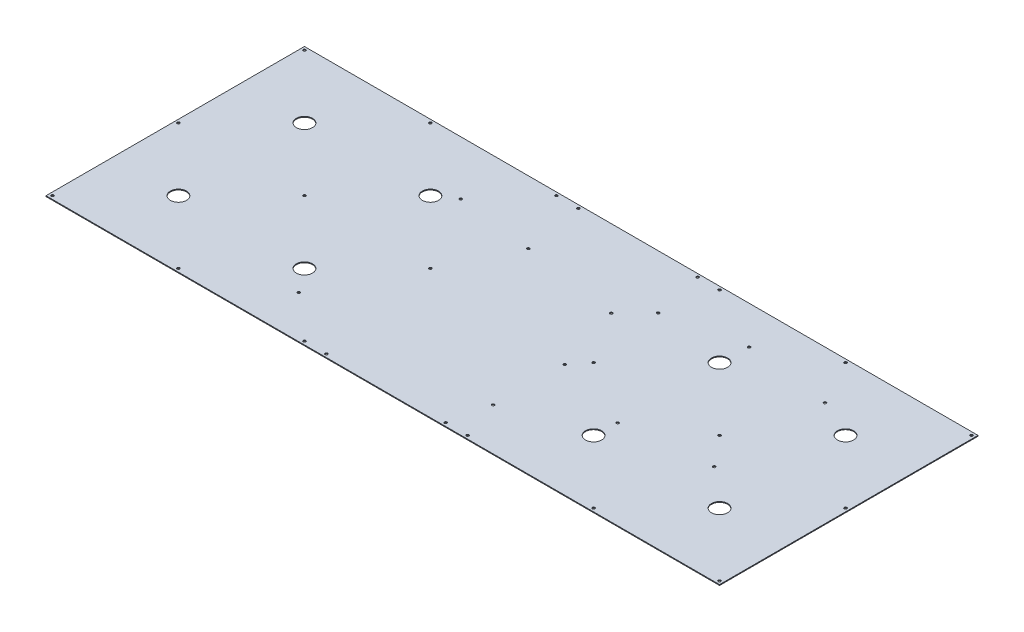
ISO-10303-21;
HEADER;
FILE_DESCRIPTION(('STEP AP214'),'2;1');
FILE_NAME('part.step','',(''),(''),'','','');
FILE_SCHEMA(('AUTOMOTIVE_DESIGN { 1 0 10303 214 1 1 1 1 }'));
ENDSEC;
DATA;
#1=APPLICATION_CONTEXT('core data for automotive mechanical design processes');
#2=APPLICATION_PROTOCOL_DEFINITION('international standard','automotive_design',2000,#1);
#3=PRODUCT_CONTEXT('',#1,'mechanical');
#4=PRODUCT('Part','Part','',(#3));
#5=PRODUCT_RELATED_PRODUCT_CATEGORY('part','',(#4));
#6=PRODUCT_DEFINITION_FORMATION('','',#4);
#7=PRODUCT_DEFINITION_CONTEXT('part definition',#1,'design');
#8=PRODUCT_DEFINITION('design','',#6,#7);
#9=PRODUCT_DEFINITION_SHAPE('','',#8);
#10=(LENGTH_UNIT() NAMED_UNIT(*) SI_UNIT(.MILLI.,.METRE.));
#11=(NAMED_UNIT(*) PLANE_ANGLE_UNIT() SI_UNIT($,.RADIAN.));
#12=(NAMED_UNIT(*) SI_UNIT($,.STERADIAN.) SOLID_ANGLE_UNIT());
#13=UNCERTAINTY_MEASURE_WITH_UNIT(LENGTH_MEASURE(1.E-05),#10,'distance_accuracy_value','');
#14=(GEOMETRIC_REPRESENTATION_CONTEXT(3) GLOBAL_UNCERTAINTY_ASSIGNED_CONTEXT((#13)) GLOBAL_UNIT_ASSIGNED_CONTEXT((#10,
#11,#12)) REPRESENTATION_CONTEXT('',''));
#15=CARTESIAN_POINT('',(0.,0.,0.));
#16=DIRECTION('',(0.,0.,1.));
#17=DIRECTION('',(1.,0.,0.));
#18=AXIS2_PLACEMENT_3D('',#15,#16,#17);
#19=CARTESIAN_POINT('',(0.,1.016,0.));
#20=DIRECTION('',(0.,1.,0.));
#21=DIRECTION('',(0.,0.,1.));
#22=AXIS2_PLACEMENT_3D('',#19,#20,#21);
#23=PLANE('',#22);
#24=CARTESIAN_POINT('',(-61.5452313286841,1.016,-81.8194516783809));
#25=DIRECTION('',(0.,1.,0.));
#26=DIRECTION('',(0.,0.,1.));
#27=AXIS2_PLACEMENT_3D('',#24,#25,#26);
#28=CIRCLE('',#27,1.60000000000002);
#29=CARTESIAN_POINT('',(-61.5452313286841,1.016,-80.2194516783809));
#30=VERTEX_POINT('',#29);
#31=EDGE_CURVE('E417',#30,#30,#28,.T.);
#32=ORIENTED_EDGE('',*,*,#31,.F.);
#33=EDGE_LOOP('',(#32));
#34=FACE_BOUND('',#33,.T.);
#35=CARTESIAN_POINT('',(287.230832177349,1.016,36.9804563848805));
#36=DIRECTION('',(0.,-1.,0.));
#37=DIRECTION('',(0.,0.,-1.));
#38=AXIS2_PLACEMENT_3D('',#35,#36,#37);
#39=CIRCLE('',#38,1.59999999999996);
#40=CARTESIAN_POINT('',(287.230832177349,1.016,35.3804563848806));
#41=VERTEX_POINT('',#40);
#42=EDGE_CURVE('E434',#41,#41,#39,.T.);
#43=ORIENTED_EDGE('',*,*,#42,.T.);
#44=EDGE_LOOP('',(#43));
#45=FACE_BOUND('',#44,.T.);
#46=CARTESIAN_POINT('',(287.304415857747,1.016,-100.179523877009));
#47=DIRECTION('',(0.,1.,0.));
#48=DIRECTION('',(0.,0.,1.));
#49=AXIS2_PLACEMENT_3D('',#46,#47,#48);
#50=CIRCLE('',#49,1.59999999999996);
#51=CARTESIAN_POINT('',(287.304415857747,1.016,-98.5795238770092));
#52=VERTEX_POINT('',#51);
#53=EDGE_CURVE('E386',#52,#52,#50,.T.);
#54=ORIENTED_EDGE('',*,*,#53,.F.);
#55=EDGE_LOOP('',(#54));
#56=FACE_BOUND('',#55,.T.);
#57=CARTESIAN_POINT('',(180.624415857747,1.016,-112.936757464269));
#58=DIRECTION('',(0.,1.,0.));
#59=DIRECTION('',(0.,0.,1.));
#60=AXIS2_PLACEMENT_3D('',#57,#58,#59);
#61=CIRCLE('',#60,1.60000000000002);
#62=CARTESIAN_POINT('',(180.624415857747,1.016,-111.336757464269));
#63=VERTEX_POINT('',#62);
#64=EDGE_CURVE('E385',#63,#63,#61,.T.);
#65=ORIENTED_EDGE('',*,*,#64,.F.);
#66=EDGE_LOOP('',(#65));
#67=FACE_BOUND('',#66,.T.);
#68=CARTESIAN_POINT('',(87.674768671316,1.016,-93.2094516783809));
#69=DIRECTION('',(0.,1.,0.));
#70=DIRECTION('',(0.,0.,1.));
#71=AXIS2_PLACEMENT_3D('',#68,#69,#70);
#72=CIRCLE('',#71,1.60000000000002);
#73=CARTESIAN_POINT('',(87.674768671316,1.016,-91.6094516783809));
#74=VERTEX_POINT('',#73);
#75=EDGE_CURVE('E394',#74,#74,#72,.T.);
#76=ORIENTED_EDGE('',*,*,#75,.F.);
#77=EDGE_LOOP('',(#76));
#78=FACE_BOUND('',#77,.T.);
#79=CARTESIAN_POINT('',(84.0372055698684,1.016,107.450548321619));
#80=DIRECTION('',(0.,1.,0.));
#81=DIRECTION('',(0.,0.,1.));
#82=AXIS2_PLACEMENT_3D('',#79,#80,#81);
#83=CIRCLE('',#82,1.60000000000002);
#84=CARTESIAN_POINT('',(84.0372055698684,1.016,109.050548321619));
#85=VERTEX_POINT('',#84);
#86=EDGE_CURVE('E402',#85,#85,#83,.T.);
#87=ORIENTED_EDGE('',*,*,#86,.F.);
#88=EDGE_LOOP('',(#87));
#89=FACE_BOUND('',#88,.T.);
#90=CARTESIAN_POINT('',(-156.805231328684,1.016,107.450548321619));
#91=DIRECTION('',(0.,1.,0.));
#92=DIRECTION('',(0.,0.,1.));
#93=AXIS2_PLACEMENT_3D('',#90,#91,#92);
#94=CIRCLE('',#93,1.60000000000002);
#95=CARTESIAN_POINT('',(-156.805231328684,1.016,109.050548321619));
#96=VERTEX_POINT('',#95);
#97=EDGE_CURVE('E377',#96,#96,#94,.T.);
#98=ORIENTED_EDGE('',*,*,#97,.F.);
#99=EDGE_LOOP('',(#98));
#100=FACE_BOUND('',#99,.T.);
#101=CARTESIAN_POINT('',(85.304768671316,1.016,19.8205483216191));
#102=DIRECTION('',(0.,1.,0.));
#103=DIRECTION('',(0.,0.,1.));
#104=AXIS2_PLACEMENT_3D('',#101,#102,#103);
#105=CIRCLE('',#104,1.60000000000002);
#106=CARTESIAN_POINT('',(85.304768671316,1.016,21.4205483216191));
#107=VERTEX_POINT('',#106);
#108=EDGE_CURVE('E418',#107,#107,#105,.T.);
#109=ORIENTED_EDGE('',*,*,#108,.F.);
#110=EDGE_LOOP('',(#109));
#111=FACE_BOUND('',#110,.T.);
#112=CARTESIAN_POINT('',(58.9247686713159,1.016,-63.9194516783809));
#113=DIRECTION('',(0.,1.,0.));
#114=DIRECTION('',(0.,0.,1.));
#115=AXIS2_PLACEMENT_3D('',#112,#113,#114);
#116=CIRCLE('',#115,1.60000000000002);
#117=CARTESIAN_POINT('',(58.9247686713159,1.016,-62.3194516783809));
#118=VERTEX_POINT('',#117);
#119=EDGE_CURVE('E449',#118,#118,#116,.T.);
#120=ORIENTED_EDGE('',*,*,#119,.F.);
#121=EDGE_LOOP('',(#120));
#122=FACE_BOUND('',#121,.T.);
#123=CARTESIAN_POINT('',(-156.795231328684,1.016,-93.2094516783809));
#124=DIRECTION('',(0.,1.,0.));
#125=DIRECTION('',(0.,0.,1.));
#126=AXIS2_PLACEMENT_3D('',#123,#124,#125);
#127=CIRCLE('',#126,1.60000000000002);
#128=CARTESIAN_POINT('',(-156.795231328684,1.016,-91.6094516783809));
#129=VERTEX_POINT('',#128);
#130=EDGE_CURVE('E373',#129,#129,#127,.T.);
#131=ORIENTED_EDGE('',*,*,#130,.F.);
#132=EDGE_LOOP('',(#131));
#133=FACE_BOUND('',#132,.T.);
#134=CARTESIAN_POINT('',(335.,1.016,-78.));
#135=DIRECTION('',(0.,1.,0.));
#136=DIRECTION('',(0.,0.,-1.));
#137=AXIS2_PLACEMENT_3D('',#134,#135,#136);
#138=CIRCLE('',#137,10.);
#139=CARTESIAN_POINT('',(335.,1.016,-88.));
#140=VERTEX_POINT('',#139);
#141=EDGE_CURVE('E313',#140,#140,#138,.T.);
#142=ORIENTED_EDGE('',*,*,#141,.F.);
#143=EDGE_LOOP('',(#142));
#144=FACE_BOUND('',#143,.T.);
#145=CARTESIAN_POINT('',(-179.,1.016,-77.9999999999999));
#146=DIRECTION('',(0.,1.,0.));
#147=DIRECTION('',(0.,0.,1.));
#148=AXIS2_PLACEMENT_3D('',#145,#146,#147);
#149=CIRCLE('',#148,10.);
#150=CARTESIAN_POINT('',(-179.,1.016,-67.9999999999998));
#151=VERTEX_POINT('',#150);
#152=EDGE_CURVE('E338',#151,#151,#149,.T.);
#153=ORIENTED_EDGE('',*,*,#152,.F.);
#154=EDGE_LOOP('',(#153));
#155=FACE_BOUND('',#154,.T.);
#156=CARTESIAN_POINT('',(-178.999999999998,1.016,78.0000000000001));
#157=DIRECTION('',(0.,1.,0.));
#158=DIRECTION('',(0.,0.,1.));
#159=AXIS2_PLACEMENT_3D('',#156,#157,#158);
#160=CIRCLE('',#159,10.);
#161=CARTESIAN_POINT('',(-178.999999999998,1.016,88.0000000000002));
#162=VERTEX_POINT('',#161);
#163=EDGE_CURVE('E330',#162,#162,#160,.T.);
#164=ORIENTED_EDGE('',*,*,#163,.F.);
#165=EDGE_LOOP('',(#164));
#166=FACE_BOUND('',#165,.T.);
#167=CARTESIAN_POINT('',(-334.999999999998,1.016,78.0000000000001));
#168=DIRECTION('',(0.,1.,0.));
#169=DIRECTION('',(0.,0.,1.));
#170=AXIS2_PLACEMENT_3D('',#167,#168,#169);
#171=CIRCLE('',#170,10.);
#172=CARTESIAN_POINT('',(-334.999999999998,1.016,88.0000000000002));
#173=VERTEX_POINT('',#172);
#174=EDGE_CURVE('E321',#173,#173,#171,.T.);
#175=ORIENTED_EDGE('',*,*,#174,.F.);
#176=EDGE_LOOP('',(#175));
#177=FACE_BOUND('',#176,.T.);
#178=CARTESIAN_POINT('',(178.999999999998,1.016,78.0000000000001));
#179=DIRECTION('',(0.,1.,0.));
#180=DIRECTION('',(0.,0.,-1.));
#181=AXIS2_PLACEMENT_3D('',#178,#179,#180);
#182=CIRCLE('',#181,10.);
#183=CARTESIAN_POINT('',(178.999999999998,1.016,68.));
#184=VERTEX_POINT('',#183);
#185=EDGE_CURVE('E354',#184,#184,#182,.T.);
#186=ORIENTED_EDGE('',*,*,#185,.F.);
#187=EDGE_LOOP('',(#186));
#188=FACE_BOUND('',#187,.T.);
#189=CARTESIAN_POINT('',(334.999999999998,1.016,78.));
#190=DIRECTION('',(0.,1.,0.));
#191=DIRECTION('',(0.,0.,-1.));
#192=AXIS2_PLACEMENT_3D('',#189,#190,#191);
#193=CIRCLE('',#192,10.);
#194=CARTESIAN_POINT('',(334.999999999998,1.016,68.));
#195=VERTEX_POINT('',#194);
#196=EDGE_CURVE('E353',#195,#195,#193,.T.);
#197=ORIENTED_EDGE('',*,*,#196,.F.);
#198=EDGE_LOOP('',(#197));
#199=FACE_BOUND('',#198,.T.);
#200=CARTESIAN_POINT('',(179.,1.016,-77.9999999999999));
#201=DIRECTION('',(0.,1.,0.));
#202=DIRECTION('',(0.,0.,-1.));
#203=AXIS2_PLACEMENT_3D('',#200,#201,#202);
#204=CIRCLE('',#203,10.0000000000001);
#205=CARTESIAN_POINT('',(179.,1.016,-88.));
#206=VERTEX_POINT('',#205);
#207=EDGE_CURVE('E322',#206,#206,#204,.T.);
#208=ORIENTED_EDGE('',*,*,#207,.F.);
#209=EDGE_LOOP('',(#208));
#210=FACE_BOUND('',#209,.T.);
#211=CARTESIAN_POINT('',(-335.,1.016,-77.9999999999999));
#212=DIRECTION('',(0.,1.,0.));
#213=DIRECTION('',(0.,0.,1.));
#214=AXIS2_PLACEMENT_3D('',#211,#212,#213);
#215=CIRCLE('',#214,10.);
#216=CARTESIAN_POINT('',(-335.,1.016,-67.9999999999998));
#217=VERTEX_POINT('',#216);
#218=EDGE_CURVE('E309',#217,#217,#215,.T.);
#219=ORIENTED_EDGE('',*,*,#218,.F.);
#220=EDGE_LOOP('',(#219));
#221=FACE_BOUND('',#220,.T.);
#222=CARTESIAN_POINT('',(256.999999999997,1.016,156.));
#223=DIRECTION('',(0.,1.,0.));
#224=DIRECTION('',(0.,0.,-1.));
#225=AXIS2_PLACEMENT_3D('',#222,#223,#224);
#226=CIRCLE('',#225,1.59999999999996);
#227=CARTESIAN_POINT('',(256.999999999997,1.016,154.4));
#228=VERTEX_POINT('',#227);
#229=EDGE_CURVE('E209',#228,#228,#226,.T.);
#230=ORIENTED_EDGE('',*,*,#229,.F.);
#231=EDGE_LOOP('',(#230));
#232=FACE_BOUND('',#231,.T.);
#233=CARTESIAN_POINT('',(100.999999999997,1.016,156.));
#234=DIRECTION('',(0.,1.,0.));
#235=DIRECTION('',(0.,0.,-1.));
#236=AXIS2_PLACEMENT_3D('',#233,#234,#235);
#237=CIRCLE('',#236,1.59999999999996);
#238=CARTESIAN_POINT('',(100.999999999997,1.016,154.4));
#239=VERTEX_POINT('',#238);
#240=EDGE_CURVE('E218',#239,#239,#237,.T.);
#241=ORIENTED_EDGE('',*,*,#240,.F.);
#242=EDGE_LOOP('',(#241));
#243=FACE_BOUND('',#242,.T.);
#244=CARTESIAN_POINT('',(412.999999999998,1.016,0.));
#245=DIRECTION('',(0.,1.,0.));
#246=DIRECTION('',(0.,0.,-1.));
#247=AXIS2_PLACEMENT_3D('',#244,#245,#246);
#248=CIRCLE('',#247,1.59999999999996);
#249=CARTESIAN_POINT('',(412.999999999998,1.016,-1.59999999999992));
#250=VERTEX_POINT('',#249);
#251=EDGE_CURVE('E226',#250,#250,#248,.T.);
#252=ORIENTED_EDGE('',*,*,#251,.F.);
#253=EDGE_LOOP('',(#252));
#254=FACE_BOUND('',#253,.T.);
#255=CARTESIAN_POINT('',(412.999999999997,1.016,156.));
#256=DIRECTION('',(0.,1.,0.));
#257=DIRECTION('',(0.,0.,-1.));
#258=AXIS2_PLACEMENT_3D('',#255,#256,#257);
#259=CIRCLE('',#258,1.59999999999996);
#260=CARTESIAN_POINT('',(412.999999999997,1.016,154.4));
#261=VERTEX_POINT('',#260);
#262=EDGE_CURVE('E234',#261,#261,#259,.T.);
#263=ORIENTED_EDGE('',*,*,#262,.F.);
#264=EDGE_LOOP('',(#263));
#265=FACE_BOUND('',#264,.T.);
#266=CARTESIAN_POINT('',(-73.81875,1.016,156.));
#267=DIRECTION('',(0.,1.,0.));
#268=DIRECTION('',(0.,0.,-1.));
#269=AXIS2_PLACEMENT_3D('',#266,#267,#268);
#270=CIRCLE('',#269,1.59999999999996);
#271=CARTESIAN_POINT('',(-73.81875,1.016,154.4));
#272=VERTEX_POINT('',#271);
#273=EDGE_CURVE('E242',#272,#272,#270,.T.);
#274=ORIENTED_EDGE('',*,*,#273,.F.);
#275=EDGE_LOOP('',(#274));
#276=FACE_BOUND('',#275,.T.);
#277=CARTESIAN_POINT('',(73.81875,1.016,156.));
#278=DIRECTION('',(0.,1.,0.));
#279=DIRECTION('',(0.,0.,1.));
#280=AXIS2_PLACEMENT_3D('',#277,#278,#279);
#281=CIRCLE('',#280,1.59999999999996);
#282=CARTESIAN_POINT('',(73.81875,1.016,157.6));
#283=VERTEX_POINT('',#282);
#284=EDGE_CURVE('E250',#283,#283,#281,.T.);
#285=ORIENTED_EDGE('',*,*,#284,.F.);
#286=EDGE_LOOP('',(#285));
#287=FACE_BOUND('',#286,.T.);
#288=CARTESIAN_POINT('',(-412.999999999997,1.016,156.));
#289=DIRECTION('',(0.,1.,0.));
#290=DIRECTION('',(0.,0.,1.));
#291=AXIS2_PLACEMENT_3D('',#288,#289,#290);
#292=CIRCLE('',#291,1.59999999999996);
#293=CARTESIAN_POINT('',(-412.999999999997,1.016,157.6));
#294=VERTEX_POINT('',#293);
#295=EDGE_CURVE('E258',#294,#294,#292,.T.);
#296=ORIENTED_EDGE('',*,*,#295,.F.);
#297=EDGE_LOOP('',(#296));
#298=FACE_BOUND('',#297,.T.);
#299=CARTESIAN_POINT('',(-412.999999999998,1.016,1.38777878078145E-13));
#300=DIRECTION('',(0.,1.,0.));
#301=DIRECTION('',(0.,0.,1.));
#302=AXIS2_PLACEMENT_3D('',#299,#300,#301);
#303=CIRCLE('',#302,1.59999999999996);
#304=CARTESIAN_POINT('',(-412.999999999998,1.016,1.6000000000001));
#305=VERTEX_POINT('',#304);
#306=EDGE_CURVE('E146',#305,#305,#303,.T.);
#307=ORIENTED_EDGE('',*,*,#306,.F.);
#308=EDGE_LOOP('',(#307));
#309=FACE_BOUND('',#308,.T.);
#310=CARTESIAN_POINT('',(-100.999999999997,1.016,156.));
#311=DIRECTION('',(0.,1.,0.));
#312=DIRECTION('',(0.,0.,1.));
#313=AXIS2_PLACEMENT_3D('',#310,#311,#312);
#314=CIRCLE('',#313,1.59999999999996);
#315=CARTESIAN_POINT('',(-100.999999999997,1.016,157.6));
#316=VERTEX_POINT('',#315);
#317=EDGE_CURVE('E145',#316,#316,#314,.T.);
#318=ORIENTED_EDGE('',*,*,#317,.F.);
#319=EDGE_LOOP('',(#318));
#320=FACE_BOUND('',#319,.T.);
#321=CARTESIAN_POINT('',(-256.999999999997,1.016,156.));
#322=DIRECTION('',(0.,1.,0.));
#323=DIRECTION('',(0.,0.,1.));
#324=AXIS2_PLACEMENT_3D('',#321,#322,#323);
#325=CIRCLE('',#324,1.59999999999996);
#326=CARTESIAN_POINT('',(-256.999999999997,1.016,157.6));
#327=VERTEX_POINT('',#326);
#328=EDGE_CURVE('E154',#327,#327,#325,.T.);
#329=ORIENTED_EDGE('',*,*,#328,.F.);
#330=EDGE_LOOP('',(#329));
#331=FACE_BOUND('',#330,.T.);
#332=CARTESIAN_POINT('',(-100.999999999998,1.016,1.38777878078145E-13));
#333=DIRECTION('',(0.,1.,0.));
#334=DIRECTION('',(0.,0.,1.));
#335=AXIS2_PLACEMENT_3D('',#332,#333,#334);
#336=CIRCLE('',#335,1.59999999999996);
#337=CARTESIAN_POINT('',(-100.999999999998,1.016,1.6000000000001));
#338=VERTEX_POINT('',#337);
#339=EDGE_CURVE('E162',#338,#338,#336,.T.);
#340=ORIENTED_EDGE('',*,*,#339,.F.);
#341=EDGE_LOOP('',(#340));
#342=FACE_BOUND('',#341,.T.);
#343=CARTESIAN_POINT('',(-256.999999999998,1.016,1.38777878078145E-13));
#344=DIRECTION('',(0.,1.,0.));
#345=DIRECTION('',(0.,0.,1.));
#346=AXIS2_PLACEMENT_3D('',#343,#344,#345);
#347=CIRCLE('',#346,1.59999999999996);
#348=CARTESIAN_POINT('',(-256.999999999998,1.016,1.6000000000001));
#349=VERTEX_POINT('',#348);
#350=EDGE_CURVE('E170',#349,#349,#347,.T.);
#351=ORIENTED_EDGE('',*,*,#350,.F.);
#352=EDGE_LOOP('',(#351));
#353=FACE_BOUND('',#352,.T.);
#354=CARTESIAN_POINT('',(-101.,1.016,-156.));
#355=DIRECTION('',(0.,1.,0.));
#356=DIRECTION('',(0.,0.,1.));
#357=AXIS2_PLACEMENT_3D('',#354,#355,#356);
#358=CIRCLE('',#357,1.59999999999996);
#359=CARTESIAN_POINT('',(-101.,1.016,-154.4));
#360=VERTEX_POINT('',#359);
#361=EDGE_CURVE('E178',#360,#360,#358,.T.);
#362=ORIENTED_EDGE('',*,*,#361,.F.);
#363=EDGE_LOOP('',(#362));
#364=FACE_BOUND('',#363,.T.);
#365=CARTESIAN_POINT('',(-257.,1.016,-156.));
#366=DIRECTION('',(0.,1.,0.));
#367=DIRECTION('',(0.,0.,1.));
#368=AXIS2_PLACEMENT_3D('',#365,#366,#367);
#369=CIRCLE('',#368,1.5999999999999);
#370=CARTESIAN_POINT('',(-257.,1.016,-154.4));
#371=VERTEX_POINT('',#370);
#372=EDGE_CURVE('E186',#371,#371,#369,.T.);
#373=ORIENTED_EDGE('',*,*,#372,.F.);
#374=EDGE_LOOP('',(#373));
#375=FACE_BOUND('',#374,.T.);
#376=CARTESIAN_POINT('',(73.81875,1.016,-156.));
#377=DIRECTION('',(0.,1.,0.));
#378=DIRECTION('',(0.,0.,-1.));
#379=AXIS2_PLACEMENT_3D('',#376,#377,#378);
#380=CIRCLE('',#379,1.59999999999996);
#381=CARTESIAN_POINT('',(73.81875,1.016,-157.6));
#382=VERTEX_POINT('',#381);
#383=EDGE_CURVE('E194',#382,#382,#380,.T.);
#384=ORIENTED_EDGE('',*,*,#383,.F.);
#385=EDGE_LOOP('',(#384));
#386=FACE_BOUND('',#385,.T.);
#387=CARTESIAN_POINT('',(-73.81875,1.016,-156.));
#388=DIRECTION('',(0.,1.,0.));
#389=DIRECTION('',(0.,0.,1.));
#390=AXIS2_PLACEMENT_3D('',#387,#388,#389);
#391=CIRCLE('',#390,1.59999999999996);
#392=CARTESIAN_POINT('',(-73.81875,1.016,-154.4));
#393=VERTEX_POINT('',#392);
#394=EDGE_CURVE('E137',#393,#393,#391,.T.);
#395=ORIENTED_EDGE('',*,*,#394,.F.);
#396=EDGE_LOOP('',(#395));
#397=FACE_BOUND('',#396,.T.);
#398=CARTESIAN_POINT('',(100.999999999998,1.016,1.14040012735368E-13));
#399=DIRECTION('',(0.,1.,0.));
#400=DIRECTION('',(0.,0.,-1.));
#401=AXIS2_PLACEMENT_3D('',#398,#399,#400);
#402=CIRCLE('',#401,1.59999999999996);
#403=CARTESIAN_POINT('',(100.999999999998,1.016,-1.59999999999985));
#404=VERTEX_POINT('',#403);
#405=EDGE_CURVE('E210',#404,#404,#402,.T.);
#406=ORIENTED_EDGE('',*,*,#405,.F.);
#407=EDGE_LOOP('',(#406));
#408=FACE_BOUND('',#407,.T.);
#409=CARTESIAN_POINT('',(256.999999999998,1.016,0.));
#410=DIRECTION('',(0.,1.,0.));
#411=DIRECTION('',(0.,0.,-1.));
#412=AXIS2_PLACEMENT_3D('',#409,#410,#411);
#413=CIRCLE('',#412,1.59999999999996);
#414=CARTESIAN_POINT('',(256.999999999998,1.016,-1.59999999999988));
#415=VERTEX_POINT('',#414);
#416=EDGE_CURVE('E298',#415,#415,#413,.T.);
#417=ORIENTED_EDGE('',*,*,#416,.F.);
#418=EDGE_LOOP('',(#417));
#419=FACE_BOUND('',#418,.T.);
#420=CARTESIAN_POINT('',(101.,1.016,-156.));
#421=DIRECTION('',(0.,1.,0.));
#422=DIRECTION('',(0.,0.,-1.));
#423=AXIS2_PLACEMENT_3D('',#420,#421,#422);
#424=CIRCLE('',#423,1.59999999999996);
#425=CARTESIAN_POINT('',(101.,1.016,-157.6));
#426=VERTEX_POINT('',#425);
#427=EDGE_CURVE('E290',#426,#426,#424,.T.);
#428=ORIENTED_EDGE('',*,*,#427,.F.);
#429=EDGE_LOOP('',(#428));
#430=FACE_BOUND('',#429,.T.);
#431=CARTESIAN_POINT('',(257.,1.016,-156.));
#432=DIRECTION('',(0.,1.,0.));
#433=DIRECTION('',(0.,0.,-1.));
#434=AXIS2_PLACEMENT_3D('',#431,#432,#433);
#435=CIRCLE('',#434,1.5999999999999);
#436=CARTESIAN_POINT('',(257.,1.016,-157.6));
#437=VERTEX_POINT('',#436);
#438=EDGE_CURVE('E282',#437,#437,#435,.T.);
#439=ORIENTED_EDGE('',*,*,#438,.F.);
#440=EDGE_LOOP('',(#439));
#441=FACE_BOUND('',#440,.T.);
#442=CARTESIAN_POINT('',(413.,1.016,-156.));
#443=DIRECTION('',(0.,1.,0.));
#444=DIRECTION('',(0.,0.,-1.));
#445=AXIS2_PLACEMENT_3D('',#442,#443,#444);
#446=CIRCLE('',#445,1.59999999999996);
#447=CARTESIAN_POINT('',(413.,1.016,-157.6));
#448=VERTEX_POINT('',#447);
#449=EDGE_CURVE('E273',#448,#448,#446,.T.);
#450=ORIENTED_EDGE('',*,*,#449,.F.);
#451=EDGE_LOOP('',(#450));
#452=FACE_BOUND('',#451,.T.);
#453=CARTESIAN_POINT('',(-413.,1.016,-156.));
#454=DIRECTION('',(0.,1.,0.));
#455=DIRECTION('',(0.,0.,1.));
#456=AXIS2_PLACEMENT_3D('',#453,#454,#455);
#457=CIRCLE('',#456,1.59999999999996);
#458=CARTESIAN_POINT('',(-413.,1.016,-154.4));
#459=VERTEX_POINT('',#458);
#460=EDGE_CURVE('E133',#459,#459,#457,.T.);
#461=ORIENTED_EDGE('',*,*,#460,.F.);
#462=EDGE_LOOP('',(#461));
#463=FACE_BOUND('',#462,.T.);
#464=DIRECTION('',(0.,0.,-1.));
#465=VECTOR('',#464,1.);
#466=CARTESIAN_POINT('',(417.,1.016,-160.));
#467=LINE('',#466,#465);
#468=CARTESIAN_POINT('',(417.,1.016,160.));
#469=VERTEX_POINT('',#468);
#470=CARTESIAN_POINT('',(417.,1.016,-160.));
#471=VERTEX_POINT('',#470);
#472=EDGE_CURVE('E95',#469,#471,#467,.T.);
#473=ORIENTED_EDGE('',*,*,#472,.T.);
#474=DIRECTION('',(-1.,0.,0.));
#475=VECTOR('',#474,1.);
#476=CARTESIAN_POINT('',(-417.,1.016,-160.));
#477=LINE('',#476,#475);
#478=CARTESIAN_POINT('',(-417.,1.016,-160.));
#479=VERTEX_POINT('',#478);
#480=EDGE_CURVE('E90',#471,#479,#477,.T.);
#481=ORIENTED_EDGE('',*,*,#480,.T.);
#482=DIRECTION('',(0.,0.,1.));
#483=VECTOR('',#482,1.);
#484=CARTESIAN_POINT('',(-417.,1.016,-160.));
#485=LINE('',#484,#483);
#486=CARTESIAN_POINT('',(-417.,1.016,160.));
#487=VERTEX_POINT('',#486);
#488=EDGE_CURVE('E93',#479,#487,#485,.T.);
#489=ORIENTED_EDGE('',*,*,#488,.T.);
#490=DIRECTION('',(1.,0.,0.));
#491=VECTOR('',#490,1.);
#492=CARTESIAN_POINT('',(-417.,1.016,160.));
#493=LINE('',#492,#491);
#494=EDGE_CURVE('E60',#487,#469,#493,.T.);
#495=ORIENTED_EDGE('',*,*,#494,.T.);
#496=EDGE_LOOP('',(#473,#481,#489,#495));
#497=FACE_BOUND('',#496,.T.);
#498=CARTESIAN_POINT('',(180.537205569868,1.016,49.6232191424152));
#499=DIRECTION('',(0.,-1.,0.));
#500=DIRECTION('',(0.,0.,-1.));
#501=AXIS2_PLACEMENT_3D('',#498,#499,#500);
#502=CIRCLE('',#501,1.60000000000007);
#503=CARTESIAN_POINT('',(180.537205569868,1.016,48.0232191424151));
#504=VERTEX_POINT('',#503);
#505=EDGE_CURVE('E426',#504,#504,#502,.T.);
#506=ORIENTED_EDGE('',*,*,#505,.T.);
#507=EDGE_LOOP('',(#506));
#508=FACE_BOUND('',#507,.T.);
#509=ADVANCED_FACE('F42',(#34,#45,#56,#67,#78,#89,#100,#111,#122,#133,#144,#155,#166,#177,#188,
#199,#210,#221,#232,#243,#254,#265,#276,#287,#298,#309,#320,#331,#342,#353,#364,#375,#386,#397,
#408,#419,#430,#441,#452,#463,#497,#508),#23,.T.);
#510=CARTESIAN_POINT('',(0.,0.,0.));
#511=DIRECTION('',(0.,1.,0.));
#512=DIRECTION('',(0.,0.,1.));
#513=AXIS2_PLACEMENT_3D('',#510,#511,#512);
#514=PLANE('',#513);
#515=CARTESIAN_POINT('',(-61.5452313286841,0.,-81.8194516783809));
#516=DIRECTION('',(0.,1.,0.));
#517=DIRECTION('',(0.,0.,1.));
#518=AXIS2_PLACEMENT_3D('',#515,#516,#517);
#519=CIRCLE('',#518,1.60000000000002);
#520=CARTESIAN_POINT('',(-61.5452313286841,0.,-80.2194516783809));
#521=VERTEX_POINT('',#520);
#522=EDGE_CURVE('E413',#521,#521,#519,.T.);
#523=ORIENTED_EDGE('',*,*,#522,.T.);
#524=EDGE_LOOP('',(#523));
#525=FACE_BOUND('',#524,.T.);
#526=CARTESIAN_POINT('',(287.304415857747,0.,-100.179523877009));
#527=DIRECTION('',(0.,1.,0.));
#528=DIRECTION('',(0.,0.,1.));
#529=AXIS2_PLACEMENT_3D('',#526,#527,#528);
#530=CIRCLE('',#529,1.59999999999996);
#531=CARTESIAN_POINT('',(287.304415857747,0.,-98.5795238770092));
#532=VERTEX_POINT('',#531);
#533=EDGE_CURVE('E438',#532,#532,#530,.T.);
#534=ORIENTED_EDGE('',*,*,#533,.T.);
#535=EDGE_LOOP('',(#534));
#536=FACE_BOUND('',#535,.T.);
#537=CARTESIAN_POINT('',(180.624415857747,0.,-112.936757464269));
#538=DIRECTION('',(0.,1.,0.));
#539=DIRECTION('',(0.,0.,1.));
#540=AXIS2_PLACEMENT_3D('',#537,#538,#539);
#541=CIRCLE('',#540,1.60000000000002);
#542=CARTESIAN_POINT('',(180.624415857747,0.,-111.336757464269));
#543=VERTEX_POINT('',#542);
#544=EDGE_CURVE('E381',#543,#543,#541,.T.);
#545=ORIENTED_EDGE('',*,*,#544,.T.);
#546=EDGE_LOOP('',(#545));
#547=FACE_BOUND('',#546,.T.);
#548=CARTESIAN_POINT('',(87.674768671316,0.,-93.2094516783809));
#549=DIRECTION('',(0.,1.,0.));
#550=DIRECTION('',(0.,0.,1.));
#551=AXIS2_PLACEMENT_3D('',#548,#549,#550);
#552=CIRCLE('',#551,1.60000000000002);
#553=CARTESIAN_POINT('',(87.674768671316,0.,-91.6094516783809));
#554=VERTEX_POINT('',#553);
#555=EDGE_CURVE('E390',#554,#554,#552,.T.);
#556=ORIENTED_EDGE('',*,*,#555,.T.);
#557=EDGE_LOOP('',(#556));
#558=FACE_BOUND('',#557,.T.);
#559=CARTESIAN_POINT('',(84.0372055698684,0.,107.450548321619));
#560=DIRECTION('',(0.,1.,0.));
#561=DIRECTION('',(0.,0.,1.));
#562=AXIS2_PLACEMENT_3D('',#559,#560,#561);
#563=CIRCLE('',#562,1.60000000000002);
#564=CARTESIAN_POINT('',(84.0372055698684,0.,109.050548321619));
#565=VERTEX_POINT('',#564);
#566=EDGE_CURVE('E398',#565,#565,#563,.T.);
#567=ORIENTED_EDGE('',*,*,#566,.T.);
#568=EDGE_LOOP('',(#567));
#569=FACE_BOUND('',#568,.T.);
#570=CARTESIAN_POINT('',(-156.805231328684,0.,107.450548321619));
#571=DIRECTION('',(0.,1.,0.));
#572=DIRECTION('',(0.,0.,1.));
#573=AXIS2_PLACEMENT_3D('',#570,#571,#572);
#574=CIRCLE('',#573,1.60000000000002);
#575=CARTESIAN_POINT('',(-156.805231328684,0.,109.050548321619));
#576=VERTEX_POINT('',#575);
#577=EDGE_CURVE('E406',#576,#576,#574,.T.);
#578=ORIENTED_EDGE('',*,*,#577,.T.);
#579=EDGE_LOOP('',(#578));
#580=FACE_BOUND('',#579,.T.);
#581=CARTESIAN_POINT('',(85.304768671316,0.,19.8205483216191));
#582=DIRECTION('',(0.,1.,0.));
#583=DIRECTION('',(0.,0.,1.));
#584=AXIS2_PLACEMENT_3D('',#581,#582,#583);
#585=CIRCLE('',#584,1.60000000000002);
#586=CARTESIAN_POINT('',(85.304768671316,0.,21.4205483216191));
#587=VERTEX_POINT('',#586);
#588=EDGE_CURVE('E453',#587,#587,#585,.T.);
#589=ORIENTED_EDGE('',*,*,#588,.T.);
#590=EDGE_LOOP('',(#589));
#591=FACE_BOUND('',#590,.T.);
#592=CARTESIAN_POINT('',(58.9247686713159,0.,-63.9194516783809));
#593=DIRECTION('',(0.,1.,0.));
#594=DIRECTION('',(0.,0.,1.));
#595=AXIS2_PLACEMENT_3D('',#592,#593,#594);
#596=CIRCLE('',#595,1.60000000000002);
#597=CARTESIAN_POINT('',(58.9247686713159,0.,-62.3194516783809));
#598=VERTEX_POINT('',#597);
#599=EDGE_CURVE('E445',#598,#598,#596,.T.);
#600=ORIENTED_EDGE('',*,*,#599,.T.);
#601=EDGE_LOOP('',(#600));
#602=FACE_BOUND('',#601,.T.);
#603=CARTESIAN_POINT('',(-156.795231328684,0.,-93.2094516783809));
#604=DIRECTION('',(0.,1.,0.));
#605=DIRECTION('',(0.,0.,1.));
#606=AXIS2_PLACEMENT_3D('',#603,#604,#605);
#607=CIRCLE('',#606,1.60000000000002);
#608=CARTESIAN_POINT('',(-156.795231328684,0.,-91.6094516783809));
#609=VERTEX_POINT('',#608);
#610=EDGE_CURVE('E369',#609,#609,#607,.T.);
#611=ORIENTED_EDGE('',*,*,#610,.T.);
#612=EDGE_LOOP('',(#611));
#613=FACE_BOUND('',#612,.T.);
#614=CARTESIAN_POINT('',(335.,0.,-78.));
#615=DIRECTION('',(0.,1.,0.));
#616=DIRECTION('',(0.,0.,-1.));
#617=AXIS2_PLACEMENT_3D('',#614,#615,#616);
#618=CIRCLE('',#617,10.);
#619=CARTESIAN_POINT('',(335.,0.,-88.));
#620=VERTEX_POINT('',#619);
#621=EDGE_CURVE('E342',#620,#620,#618,.T.);
#622=ORIENTED_EDGE('',*,*,#621,.T.);
#623=EDGE_LOOP('',(#622));
#624=FACE_BOUND('',#623,.T.);
#625=CARTESIAN_POINT('',(-179.,0.,-77.9999999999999));
#626=DIRECTION('',(0.,1.,0.));
#627=DIRECTION('',(0.,0.,1.));
#628=AXIS2_PLACEMENT_3D('',#625,#626,#627);
#629=CIRCLE('',#628,10.);
#630=CARTESIAN_POINT('',(-179.,0.,-67.9999999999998));
#631=VERTEX_POINT('',#630);
#632=EDGE_CURVE('E334',#631,#631,#629,.T.);
#633=ORIENTED_EDGE('',*,*,#632,.T.);
#634=EDGE_LOOP('',(#633));
#635=FACE_BOUND('',#634,.T.);
#636=CARTESIAN_POINT('',(-178.999999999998,0.,78.0000000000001));
#637=DIRECTION('',(0.,1.,0.));
#638=DIRECTION('',(0.,0.,1.));
#639=AXIS2_PLACEMENT_3D('',#636,#637,#638);
#640=CIRCLE('',#639,10.);
#641=CARTESIAN_POINT('',(-178.999999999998,0.,88.0000000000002));
#642=VERTEX_POINT('',#641);
#643=EDGE_CURVE('E326',#642,#642,#640,.T.);
#644=ORIENTED_EDGE('',*,*,#643,.T.);
#645=EDGE_LOOP('',(#644));
#646=FACE_BOUND('',#645,.T.);
#647=CARTESIAN_POINT('',(-334.999999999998,0.,78.0000000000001));
#648=DIRECTION('',(0.,1.,0.));
#649=DIRECTION('',(0.,0.,1.));
#650=AXIS2_PLACEMENT_3D('',#647,#648,#649);
#651=CIRCLE('',#650,10.);
#652=CARTESIAN_POINT('',(-334.999999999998,0.,88.0000000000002));
#653=VERTEX_POINT('',#652);
#654=EDGE_CURVE('E317',#653,#653,#651,.T.);
#655=ORIENTED_EDGE('',*,*,#654,.T.);
#656=EDGE_LOOP('',(#655));
#657=FACE_BOUND('',#656,.T.);
#658=CARTESIAN_POINT('',(178.999999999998,0.,78.0000000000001));
#659=DIRECTION('',(0.,1.,0.));
#660=DIRECTION('',(0.,0.,-1.));
#661=AXIS2_PLACEMENT_3D('',#658,#659,#660);
#662=CIRCLE('',#661,10.);
#663=CARTESIAN_POINT('',(178.999999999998,0.,68.));
#664=VERTEX_POINT('',#663);
#665=EDGE_CURVE('E365',#664,#664,#662,.T.);
#666=ORIENTED_EDGE('',*,*,#665,.T.);
#667=EDGE_LOOP('',(#666));
#668=FACE_BOUND('',#667,.T.);
#669=CARTESIAN_POINT('',(334.999999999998,0.,78.));
#670=DIRECTION('',(0.,1.,0.));
#671=DIRECTION('',(0.,0.,-1.));
#672=AXIS2_PLACEMENT_3D('',#669,#670,#671);
#673=CIRCLE('',#672,10.);
#674=CARTESIAN_POINT('',(334.999999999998,0.,68.));
#675=VERTEX_POINT('',#674);
#676=EDGE_CURVE('E349',#675,#675,#673,.T.);
#677=ORIENTED_EDGE('',*,*,#676,.T.);
#678=EDGE_LOOP('',(#677));
#679=FACE_BOUND('',#678,.T.);
#680=CARTESIAN_POINT('',(179.,0.,-77.9999999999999));
#681=DIRECTION('',(0.,1.,0.));
#682=DIRECTION('',(0.,0.,-1.));
#683=AXIS2_PLACEMENT_3D('',#680,#681,#682);
#684=CIRCLE('',#683,10.0000000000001);
#685=CARTESIAN_POINT('',(179.,0.,-88.));
#686=VERTEX_POINT('',#685);
#687=EDGE_CURVE('E358',#686,#686,#684,.T.);
#688=ORIENTED_EDGE('',*,*,#687,.T.);
#689=EDGE_LOOP('',(#688));
#690=FACE_BOUND('',#689,.T.);
#691=CARTESIAN_POINT('',(-335.,0.,-77.9999999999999));
#692=DIRECTION('',(0.,1.,0.));
#693=DIRECTION('',(0.,0.,1.));
#694=AXIS2_PLACEMENT_3D('',#691,#692,#693);
#695=CIRCLE('',#694,10.);
#696=CARTESIAN_POINT('',(-335.,0.,-67.9999999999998));
#697=VERTEX_POINT('',#696);
#698=EDGE_CURVE('E274',#697,#697,#695,.T.);
#699=ORIENTED_EDGE('',*,*,#698,.T.);
#700=EDGE_LOOP('',(#699));
#701=FACE_BOUND('',#700,.T.);
#702=CARTESIAN_POINT('',(256.999999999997,0.,156.));
#703=DIRECTION('',(0.,1.,0.));
#704=DIRECTION('',(0.,0.,-1.));
#705=AXIS2_PLACEMENT_3D('',#702,#703,#704);
#706=CIRCLE('',#705,1.59999999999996);
#707=CARTESIAN_POINT('',(256.999999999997,0.,154.4));
#708=VERTEX_POINT('',#707);
#709=EDGE_CURVE('E205',#708,#708,#706,.T.);
#710=ORIENTED_EDGE('',*,*,#709,.T.);
#711=EDGE_LOOP('',(#710));
#712=FACE_BOUND('',#711,.T.);
#713=CARTESIAN_POINT('',(100.999999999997,0.,156.));
#714=DIRECTION('',(0.,1.,0.));
#715=DIRECTION('',(0.,0.,-1.));
#716=AXIS2_PLACEMENT_3D('',#713,#714,#715);
#717=CIRCLE('',#716,1.59999999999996);
#718=CARTESIAN_POINT('',(100.999999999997,0.,154.4));
#719=VERTEX_POINT('',#718);
#720=EDGE_CURVE('E214',#719,#719,#717,.T.);
#721=ORIENTED_EDGE('',*,*,#720,.T.);
#722=EDGE_LOOP('',(#721));
#723=FACE_BOUND('',#722,.T.);
#724=CARTESIAN_POINT('',(412.999999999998,0.,0.));
#725=DIRECTION('',(0.,1.,0.));
#726=DIRECTION('',(0.,0.,-1.));
#727=AXIS2_PLACEMENT_3D('',#724,#725,#726);
#728=CIRCLE('',#727,1.59999999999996);
#729=CARTESIAN_POINT('',(412.999999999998,0.,-1.59999999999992));
#730=VERTEX_POINT('',#729);
#731=EDGE_CURVE('E222',#730,#730,#728,.T.);
#732=ORIENTED_EDGE('',*,*,#731,.T.);
#733=EDGE_LOOP('',(#732));
#734=FACE_BOUND('',#733,.T.);
#735=CARTESIAN_POINT('',(412.999999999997,0.,156.));
#736=DIRECTION('',(0.,1.,0.));
#737=DIRECTION('',(0.,0.,-1.));
#738=AXIS2_PLACEMENT_3D('',#735,#736,#737);
#739=CIRCLE('',#738,1.59999999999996);
#740=CARTESIAN_POINT('',(412.999999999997,0.,154.4));
#741=VERTEX_POINT('',#740);
#742=EDGE_CURVE('E230',#741,#741,#739,.T.);
#743=ORIENTED_EDGE('',*,*,#742,.T.);
#744=EDGE_LOOP('',(#743));
#745=FACE_BOUND('',#744,.T.);
#746=CARTESIAN_POINT('',(-73.81875,0.,156.));
#747=DIRECTION('',(0.,1.,0.));
#748=DIRECTION('',(0.,0.,-1.));
#749=AXIS2_PLACEMENT_3D('',#746,#747,#748);
#750=CIRCLE('',#749,1.59999999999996);
#751=CARTESIAN_POINT('',(-73.81875,0.,154.4));
#752=VERTEX_POINT('',#751);
#753=EDGE_CURVE('E238',#752,#752,#750,.T.);
#754=ORIENTED_EDGE('',*,*,#753,.T.);
#755=EDGE_LOOP('',(#754));
#756=FACE_BOUND('',#755,.T.);
#757=CARTESIAN_POINT('',(73.81875,0.,156.));
#758=DIRECTION('',(0.,1.,0.));
#759=DIRECTION('',(0.,0.,1.));
#760=AXIS2_PLACEMENT_3D('',#757,#758,#759);
#761=CIRCLE('',#760,1.59999999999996);
#762=CARTESIAN_POINT('',(73.81875,0.,157.6));
#763=VERTEX_POINT('',#762);
#764=EDGE_CURVE('E246',#763,#763,#761,.T.);
#765=ORIENTED_EDGE('',*,*,#764,.T.);
#766=EDGE_LOOP('',(#765));
#767=FACE_BOUND('',#766,.T.);
#768=CARTESIAN_POINT('',(-412.999999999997,0.,156.));
#769=DIRECTION('',(0.,1.,0.));
#770=DIRECTION('',(0.,0.,1.));
#771=AXIS2_PLACEMENT_3D('',#768,#769,#770);
#772=CIRCLE('',#771,1.59999999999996);
#773=CARTESIAN_POINT('',(-412.999999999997,0.,157.6));
#774=VERTEX_POINT('',#773);
#775=EDGE_CURVE('E254',#774,#774,#772,.T.);
#776=ORIENTED_EDGE('',*,*,#775,.T.);
#777=EDGE_LOOP('',(#776));
#778=FACE_BOUND('',#777,.T.);
#779=CARTESIAN_POINT('',(-412.999999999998,0.,1.38777878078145E-13));
#780=DIRECTION('',(0.,1.,0.));
#781=DIRECTION('',(0.,0.,1.));
#782=AXIS2_PLACEMENT_3D('',#779,#780,#781);
#783=CIRCLE('',#782,1.59999999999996);
#784=CARTESIAN_POINT('',(-412.999999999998,0.,1.6000000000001));
#785=VERTEX_POINT('',#784);
#786=EDGE_CURVE('E262',#785,#785,#783,.T.);
#787=ORIENTED_EDGE('',*,*,#786,.T.);
#788=EDGE_LOOP('',(#787));
#789=FACE_BOUND('',#788,.T.);
#790=CARTESIAN_POINT('',(-100.999999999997,0.,156.));
#791=DIRECTION('',(0.,1.,0.));
#792=DIRECTION('',(0.,0.,1.));
#793=AXIS2_PLACEMENT_3D('',#790,#791,#792);
#794=CIRCLE('',#793,1.59999999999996);
#795=CARTESIAN_POINT('',(-100.999999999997,0.,157.6));
#796=VERTEX_POINT('',#795);
#797=EDGE_CURVE('E141',#796,#796,#794,.T.);
#798=ORIENTED_EDGE('',*,*,#797,.T.);
#799=EDGE_LOOP('',(#798));
#800=FACE_BOUND('',#799,.T.);
#801=CARTESIAN_POINT('',(-256.999999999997,0.,156.));
#802=DIRECTION('',(0.,1.,0.));
#803=DIRECTION('',(0.,0.,1.));
#804=AXIS2_PLACEMENT_3D('',#801,#802,#803);
#805=CIRCLE('',#804,1.59999999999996);
#806=CARTESIAN_POINT('',(-256.999999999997,0.,157.6));
#807=VERTEX_POINT('',#806);
#808=EDGE_CURVE('E150',#807,#807,#805,.T.);
#809=ORIENTED_EDGE('',*,*,#808,.T.);
#810=EDGE_LOOP('',(#809));
#811=FACE_BOUND('',#810,.T.);
#812=CARTESIAN_POINT('',(-100.999999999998,0.,1.38777878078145E-13));
#813=DIRECTION('',(0.,1.,0.));
#814=DIRECTION('',(0.,0.,1.));
#815=AXIS2_PLACEMENT_3D('',#812,#813,#814);
#816=CIRCLE('',#815,1.59999999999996);
#817=CARTESIAN_POINT('',(-100.999999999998,0.,1.6000000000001));
#818=VERTEX_POINT('',#817);
#819=EDGE_CURVE('E158',#818,#818,#816,.T.);
#820=ORIENTED_EDGE('',*,*,#819,.T.);
#821=EDGE_LOOP('',(#820));
#822=FACE_BOUND('',#821,.T.);
#823=CARTESIAN_POINT('',(-256.999999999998,0.,1.38777878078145E-13));
#824=DIRECTION('',(0.,1.,0.));
#825=DIRECTION('',(0.,0.,1.));
#826=AXIS2_PLACEMENT_3D('',#823,#824,#825);
#827=CIRCLE('',#826,1.59999999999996);
#828=CARTESIAN_POINT('',(-256.999999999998,0.,1.6000000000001));
#829=VERTEX_POINT('',#828);
#830=EDGE_CURVE('E166',#829,#829,#827,.T.);
#831=ORIENTED_EDGE('',*,*,#830,.T.);
#832=EDGE_LOOP('',(#831));
#833=FACE_BOUND('',#832,.T.);
#834=CARTESIAN_POINT('',(-101.,0.,-156.));
#835=DIRECTION('',(0.,1.,0.));
#836=DIRECTION('',(0.,0.,1.));
#837=AXIS2_PLACEMENT_3D('',#834,#835,#836);
#838=CIRCLE('',#837,1.59999999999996);
#839=CARTESIAN_POINT('',(-101.,0.,-154.4));
#840=VERTEX_POINT('',#839);
#841=EDGE_CURVE('E174',#840,#840,#838,.T.);
#842=ORIENTED_EDGE('',*,*,#841,.T.);
#843=EDGE_LOOP('',(#842));
#844=FACE_BOUND('',#843,.T.);
#845=CARTESIAN_POINT('',(-257.,0.,-156.));
#846=DIRECTION('',(0.,1.,0.));
#847=DIRECTION('',(0.,0.,1.));
#848=AXIS2_PLACEMENT_3D('',#845,#846,#847);
#849=CIRCLE('',#848,1.5999999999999);
#850=CARTESIAN_POINT('',(-257.,0.,-154.4));
#851=VERTEX_POINT('',#850);
#852=EDGE_CURVE('E182',#851,#851,#849,.T.);
#853=ORIENTED_EDGE('',*,*,#852,.T.);
#854=EDGE_LOOP('',(#853));
#855=FACE_BOUND('',#854,.T.);
#856=CARTESIAN_POINT('',(73.81875,0.,-156.));
#857=DIRECTION('',(0.,1.,0.));
#858=DIRECTION('',(0.,0.,-1.));
#859=AXIS2_PLACEMENT_3D('',#856,#857,#858);
#860=CIRCLE('',#859,1.59999999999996);
#861=CARTESIAN_POINT('',(73.81875,0.,-157.6));
#862=VERTEX_POINT('',#861);
#863=EDGE_CURVE('E190',#862,#862,#860,.T.);
#864=ORIENTED_EDGE('',*,*,#863,.T.);
#865=EDGE_LOOP('',(#864));
#866=FACE_BOUND('',#865,.T.);
#867=CARTESIAN_POINT('',(-73.81875,0.,-156.));
#868=DIRECTION('',(0.,1.,0.));
#869=DIRECTION('',(0.,0.,1.));
#870=AXIS2_PLACEMENT_3D('',#867,#868,#869);
#871=CIRCLE('',#870,1.59999999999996);
#872=CARTESIAN_POINT('',(-73.81875,0.,-154.4));
#873=VERTEX_POINT('',#872);
#874=EDGE_CURVE('E198',#873,#873,#871,.T.);
#875=ORIENTED_EDGE('',*,*,#874,.T.);
#876=EDGE_LOOP('',(#875));
#877=FACE_BOUND('',#876,.T.);
#878=CARTESIAN_POINT('',(100.999999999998,0.,1.14040012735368E-13));
#879=DIRECTION('',(0.,1.,0.));
#880=DIRECTION('',(0.,0.,-1.));
#881=AXIS2_PLACEMENT_3D('',#878,#879,#880);
#882=CIRCLE('',#881,1.59999999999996);
#883=CARTESIAN_POINT('',(100.999999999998,0.,-1.59999999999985));
#884=VERTEX_POINT('',#883);
#885=EDGE_CURVE('E302',#884,#884,#882,.T.);
#886=ORIENTED_EDGE('',*,*,#885,.T.);
#887=EDGE_LOOP('',(#886));
#888=FACE_BOUND('',#887,.T.);
#889=CARTESIAN_POINT('',(256.999999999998,0.,0.));
#890=DIRECTION('',(0.,1.,0.));
#891=DIRECTION('',(0.,0.,-1.));
#892=AXIS2_PLACEMENT_3D('',#889,#890,#891);
#893=CIRCLE('',#892,1.59999999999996);
#894=CARTESIAN_POINT('',(256.999999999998,0.,-1.59999999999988));
#895=VERTEX_POINT('',#894);
#896=EDGE_CURVE('E294',#895,#895,#893,.T.);
#897=ORIENTED_EDGE('',*,*,#896,.T.);
#898=EDGE_LOOP('',(#897));
#899=FACE_BOUND('',#898,.T.);
#900=CARTESIAN_POINT('',(101.,0.,-156.));
#901=DIRECTION('',(0.,1.,0.));
#902=DIRECTION('',(0.,0.,-1.));
#903=AXIS2_PLACEMENT_3D('',#900,#901,#902);
#904=CIRCLE('',#903,1.59999999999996);
#905=CARTESIAN_POINT('',(101.,0.,-157.6));
#906=VERTEX_POINT('',#905);
#907=EDGE_CURVE('E286',#906,#906,#904,.T.);
#908=ORIENTED_EDGE('',*,*,#907,.T.);
#909=EDGE_LOOP('',(#908));
#910=FACE_BOUND('',#909,.T.);
#911=CARTESIAN_POINT('',(257.,0.,-156.));
#912=DIRECTION('',(0.,1.,0.));
#913=DIRECTION('',(0.,0.,-1.));
#914=AXIS2_PLACEMENT_3D('',#911,#912,#913);
#915=CIRCLE('',#914,1.5999999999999);
#916=CARTESIAN_POINT('',(257.,0.,-157.6));
#917=VERTEX_POINT('',#916);
#918=EDGE_CURVE('E278',#917,#917,#915,.T.);
#919=ORIENTED_EDGE('',*,*,#918,.T.);
#920=EDGE_LOOP('',(#919));
#921=FACE_BOUND('',#920,.T.);
#922=CARTESIAN_POINT('',(413.,0.,-156.));
#923=DIRECTION('',(0.,1.,0.));
#924=DIRECTION('',(0.,0.,-1.));
#925=AXIS2_PLACEMENT_3D('',#922,#923,#924);
#926=CIRCLE('',#925,1.59999999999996);
#927=CARTESIAN_POINT('',(413.,0.,-157.6));
#928=VERTEX_POINT('',#927);
#929=EDGE_CURVE('E269',#928,#928,#926,.T.);
#930=ORIENTED_EDGE('',*,*,#929,.T.);
#931=EDGE_LOOP('',(#930));
#932=FACE_BOUND('',#931,.T.);
#933=CARTESIAN_POINT('',(-413.,0.,-156.));
#934=DIRECTION('',(0.,1.,0.));
#935=DIRECTION('',(0.,0.,1.));
#936=AXIS2_PLACEMENT_3D('',#933,#934,#935);
#937=CIRCLE('',#936,1.59999999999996);
#938=CARTESIAN_POINT('',(-413.,0.,-154.4));
#939=VERTEX_POINT('',#938);
#940=EDGE_CURVE('E115',#939,#939,#937,.T.);
#941=ORIENTED_EDGE('',*,*,#940,.T.);
#942=EDGE_LOOP('',(#941));
#943=FACE_BOUND('',#942,.T.);
#944=DIRECTION('',(0.,0.,-1.));
#945=VECTOR('',#944,1.);
#946=CARTESIAN_POINT('',(417.,0.,-160.));
#947=LINE('',#946,#945);
#948=CARTESIAN_POINT('',(417.,0.,160.));
#949=VERTEX_POINT('',#948);
#950=CARTESIAN_POINT('',(417.,0.,-160.));
#951=VERTEX_POINT('',#950);
#952=EDGE_CURVE('E111',#949,#951,#947,.T.);
#953=ORIENTED_EDGE('',*,*,#952,.F.);
#954=DIRECTION('',(1.,0.,0.));
#955=VECTOR('',#954,1.);
#956=CARTESIAN_POINT('',(-417.,0.,160.));
#957=LINE('',#956,#955);
#958=CARTESIAN_POINT('',(-417.,0.,160.));
#959=VERTEX_POINT('',#958);
#960=EDGE_CURVE('E83',#959,#949,#957,.T.);
#961=ORIENTED_EDGE('',*,*,#960,.F.);
#962=DIRECTION('',(0.,0.,1.));
#963=VECTOR('',#962,1.);
#964=CARTESIAN_POINT('',(-417.,0.,-160.));
#965=LINE('',#964,#963);
#966=CARTESIAN_POINT('',(-417.,0.,-160.));
#967=VERTEX_POINT('',#966);
#968=EDGE_CURVE('E77',#967,#959,#965,.T.);
#969=ORIENTED_EDGE('',*,*,#968,.F.);
#970=DIRECTION('',(-1.,0.,0.));
#971=VECTOR('',#970,1.);
#972=CARTESIAN_POINT('',(-417.,0.,-160.));
#973=LINE('',#972,#971);
#974=EDGE_CURVE('E100',#951,#967,#973,.T.);
#975=ORIENTED_EDGE('',*,*,#974,.F.);
#976=EDGE_LOOP('',(#953,#961,#969,#975));
#977=FACE_BOUND('',#976,.T.);
#978=CARTESIAN_POINT('',(287.230832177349,0.,36.9804563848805));
#979=DIRECTION('',(0.,-1.,0.));
#980=DIRECTION('',(0.,0.,-1.));
#981=AXIS2_PLACEMENT_3D('',#978,#979,#980);
#982=CIRCLE('',#981,1.59999999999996);
#983=CARTESIAN_POINT('',(287.230832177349,0.,35.3804563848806));
#984=VERTEX_POINT('',#983);
#985=EDGE_CURVE('E430',#984,#984,#982,.T.);
#986=ORIENTED_EDGE('',*,*,#985,.F.);
#987=EDGE_LOOP('',(#986));
#988=FACE_BOUND('',#987,.T.);
#989=CARTESIAN_POINT('',(180.537205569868,0.,49.6232191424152));
#990=DIRECTION('',(0.,-1.,0.));
#991=DIRECTION('',(0.,0.,-1.));
#992=AXIS2_PLACEMENT_3D('',#989,#990,#991);
#993=CIRCLE('',#992,1.60000000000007);
#994=CARTESIAN_POINT('',(180.537205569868,0.,48.0232191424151));
#995=VERTEX_POINT('',#994);
#996=EDGE_CURVE('E422',#995,#995,#993,.T.);
#997=ORIENTED_EDGE('',*,*,#996,.F.);
#998=EDGE_LOOP('',(#997));
#999=FACE_BOUND('',#998,.T.);
#1000=ADVANCED_FACE('F128',(#525,#536,#547,#558,#569,#580,#591,#602,#613,#624,#635,#646,#657,
#668,#679,#690,#701,#712,#723,#734,#745,#756,#767,#778,#789,#800,#811,#822,#833,#844,#855,#866,
#877,#888,#899,#910,#921,#932,#943,#977,#988,#999),#514,.F.);
#1001=CARTESIAN_POINT('',(417.,1.016,-160.));
#1002=DIRECTION('',(-1.,0.,0.));
#1003=DIRECTION('',(0.,0.,1.));
#1004=AXIS2_PLACEMENT_3D('',#1001,#1002,#1003);
#1005=PLANE('',#1004);
#1006=ORIENTED_EDGE('',*,*,#952,.T.);
#1007=DIRECTION('',(0.,-1.,0.));
#1008=VECTOR('',#1007,1.);
#1009=CARTESIAN_POINT('',(417.,1.016,-160.));
#1010=LINE('',#1009,#1008);
#1011=EDGE_CURVE('E11',#471,#951,#1010,.T.);
#1012=ORIENTED_EDGE('',*,*,#1011,.F.);
#1013=ORIENTED_EDGE('',*,*,#472,.F.);
#1014=DIRECTION('',(0.,-1.,0.));
#1015=VECTOR('',#1014,1.);
#1016=CARTESIAN_POINT('',(417.,1.016,160.));
#1017=LINE('',#1016,#1015);
#1018=EDGE_CURVE('E107',#469,#949,#1017,.T.);
#1019=ORIENTED_EDGE('',*,*,#1018,.T.);
#1020=EDGE_LOOP('',(#1006,#1012,#1013,#1019));
#1021=FACE_BOUND('',#1020,.T.);
#1022=ADVANCED_FACE('F44',(#1021),#1005,.F.);
#1023=CARTESIAN_POINT('',(-417.,1.016,-160.));
#1024=DIRECTION('',(0.,0.,1.));
#1025=DIRECTION('',(1.,0.,0.));
#1026=AXIS2_PLACEMENT_3D('',#1023,#1024,#1025);
#1027=PLANE('',#1026);
#1028=ORIENTED_EDGE('',*,*,#974,.T.);
#1029=DIRECTION('',(0.,-1.,0.));
#1030=VECTOR('',#1029,1.);
#1031=CARTESIAN_POINT('',(-417.,1.016,-160.));
#1032=LINE('',#1031,#1030);
#1033=EDGE_CURVE('E52',#479,#967,#1032,.T.);
#1034=ORIENTED_EDGE('',*,*,#1033,.F.);
#1035=ORIENTED_EDGE('',*,*,#480,.F.);
#1036=ORIENTED_EDGE('',*,*,#1011,.T.);
#1037=EDGE_LOOP('',(#1028,#1034,#1035,#1036));
#1038=FACE_BOUND('',#1037,.T.);
#1039=ADVANCED_FACE('F99',(#1038),#1027,.F.);
#1040=CARTESIAN_POINT('',(-417.,1.016,-160.));
#1041=DIRECTION('',(1.,0.,0.));
#1042=DIRECTION('',(0.,0.,-1.));
#1043=AXIS2_PLACEMENT_3D('',#1040,#1041,#1042);
#1044=PLANE('',#1043);
#1045=ORIENTED_EDGE('',*,*,#968,.T.);
#1046=DIRECTION('',(0.,-1.,0.));
#1047=VECTOR('',#1046,1.);
#1048=CARTESIAN_POINT('',(-417.,1.016,160.));
#1049=LINE('',#1048,#1047);
#1050=EDGE_CURVE('E102',#487,#959,#1049,.T.);
#1051=ORIENTED_EDGE('',*,*,#1050,.F.);
#1052=ORIENTED_EDGE('',*,*,#488,.F.);
#1053=ORIENTED_EDGE('',*,*,#1033,.T.);
#1054=EDGE_LOOP('',(#1045,#1051,#1052,#1053));
#1055=FACE_BOUND('',#1054,.T.);
#1056=ADVANCED_FACE('F103',(#1055),#1044,.F.);
#1057=CARTESIAN_POINT('',(-417.,1.016,160.));
#1058=DIRECTION('',(0.,0.,-1.));
#1059=DIRECTION('',(-1.,0.,0.));
#1060=AXIS2_PLACEMENT_3D('',#1057,#1058,#1059);
#1061=PLANE('',#1060);
#1062=ORIENTED_EDGE('',*,*,#960,.T.);
#1063=ORIENTED_EDGE('',*,*,#1018,.F.);
#1064=ORIENTED_EDGE('',*,*,#494,.F.);
#1065=ORIENTED_EDGE('',*,*,#1050,.T.);
#1066=EDGE_LOOP('',(#1062,#1063,#1064,#1065));
#1067=FACE_BOUND('',#1066,.T.);
#1068=ADVANCED_FACE('F125',(#1067),#1061,.F.);
#1069=CARTESIAN_POINT('',(-413.,0.,-156.));
#1070=DIRECTION('',(0.,1.,0.));
#1071=DIRECTION('',(0.,0.,1.));
#1072=AXIS2_PLACEMENT_3D('',#1069,#1070,#1071);
#1073=CYLINDRICAL_SURFACE('',#1072,1.59999999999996);
#1074=ORIENTED_EDGE('',*,*,#940,.F.);
#1075=EDGE_LOOP('',(#1074));
#1076=FACE_BOUND('',#1075,.T.);
#1077=ORIENTED_EDGE('',*,*,#460,.T.);
#1078=EDGE_LOOP('',(#1077));
#1079=FACE_BOUND('',#1078,.T.);
#1080=ADVANCED_FACE('F531',(#1076,#1079),#1073,.F.);
#1081=CARTESIAN_POINT('',(413.,0.,-156.));
#1082=DIRECTION('',(0.,1.,0.));
#1083=DIRECTION('',(0.,0.,1.));
#1084=AXIS2_PLACEMENT_3D('',#1081,#1082,#1083);
#1085=CYLINDRICAL_SURFACE('',#1084,1.59999999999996);
#1086=ORIENTED_EDGE('',*,*,#929,.F.);
#1087=EDGE_LOOP('',(#1086));
#1088=FACE_BOUND('',#1087,.T.);
#1089=ORIENTED_EDGE('',*,*,#449,.T.);
#1090=EDGE_LOOP('',(#1089));
#1091=FACE_BOUND('',#1090,.T.);
#1092=ADVANCED_FACE('F533',(#1088,#1091),#1085,.F.);
#1093=CARTESIAN_POINT('',(257.,0.,-156.));
#1094=DIRECTION('',(0.,1.,0.));
#1095=DIRECTION('',(0.,0.,1.));
#1096=AXIS2_PLACEMENT_3D('',#1093,#1094,#1095);
#1097=CYLINDRICAL_SURFACE('',#1096,1.5999999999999);
#1098=ORIENTED_EDGE('',*,*,#918,.F.);
#1099=EDGE_LOOP('',(#1098));
#1100=FACE_BOUND('',#1099,.T.);
#1101=ORIENTED_EDGE('',*,*,#438,.T.);
#1102=EDGE_LOOP('',(#1101));
#1103=FACE_BOUND('',#1102,.T.);
#1104=ADVANCED_FACE('F540',(#1100,#1103),#1097,.F.);
#1105=CARTESIAN_POINT('',(101.,0.,-156.));
#1106=DIRECTION('',(0.,1.,0.));
#1107=DIRECTION('',(0.,0.,1.));
#1108=AXIS2_PLACEMENT_3D('',#1105,#1106,#1107);
#1109=CYLINDRICAL_SURFACE('',#1108,1.59999999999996);
#1110=ORIENTED_EDGE('',*,*,#907,.F.);
#1111=EDGE_LOOP('',(#1110));
#1112=FACE_BOUND('',#1111,.T.);
#1113=ORIENTED_EDGE('',*,*,#427,.T.);
#1114=EDGE_LOOP('',(#1113));
#1115=FACE_BOUND('',#1114,.T.);
#1116=ADVANCED_FACE('F854',(#1112,#1115),#1109,.F.);
#1117=CARTESIAN_POINT('',(256.999999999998,0.,0.));
#1118=DIRECTION('',(0.,1.,0.));
#1119=DIRECTION('',(0.,0.,1.));
#1120=AXIS2_PLACEMENT_3D('',#1117,#1118,#1119);
#1121=CYLINDRICAL_SURFACE('',#1120,1.59999999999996);
#1122=ORIENTED_EDGE('',*,*,#896,.F.);
#1123=EDGE_LOOP('',(#1122));
#1124=FACE_BOUND('',#1123,.T.);
#1125=ORIENTED_EDGE('',*,*,#416,.T.);
#1126=EDGE_LOOP('',(#1125));
#1127=FACE_BOUND('',#1126,.T.);
#1128=ADVANCED_FACE('F843',(#1124,#1127),#1121,.F.);
#1129=CARTESIAN_POINT('',(100.999999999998,0.,1.14040012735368E-13));
#1130=DIRECTION('',(0.,1.,0.));
#1131=DIRECTION('',(0.,0.,1.));
#1132=AXIS2_PLACEMENT_3D('',#1129,#1130,#1131);
#1133=CYLINDRICAL_SURFACE('',#1132,1.59999999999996);
#1134=ORIENTED_EDGE('',*,*,#885,.F.);
#1135=EDGE_LOOP('',(#1134));
#1136=FACE_BOUND('',#1135,.T.);
#1137=ORIENTED_EDGE('',*,*,#405,.T.);
#1138=EDGE_LOOP('',(#1137));
#1139=FACE_BOUND('',#1138,.T.);
#1140=ADVANCED_FACE('F832',(#1136,#1139),#1133,.F.);
#1141=CARTESIAN_POINT('',(-73.81875,0.,-156.));
#1142=DIRECTION('',(0.,1.,0.));
#1143=DIRECTION('',(0.,0.,1.));
#1144=AXIS2_PLACEMENT_3D('',#1141,#1142,#1143);
#1145=CYLINDRICAL_SURFACE('',#1144,1.59999999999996);
#1146=ORIENTED_EDGE('',*,*,#874,.F.);
#1147=EDGE_LOOP('',(#1146));
#1148=FACE_BOUND('',#1147,.T.);
#1149=ORIENTED_EDGE('',*,*,#394,.T.);
#1150=EDGE_LOOP('',(#1149));
#1151=FACE_BOUND('',#1150,.T.);
#1152=ADVANCED_FACE('F821',(#1148,#1151),#1145,.F.);
#1153=CARTESIAN_POINT('',(73.81875,0.,-156.));
#1154=DIRECTION('',(0.,1.,0.));
#1155=DIRECTION('',(0.,0.,1.));
#1156=AXIS2_PLACEMENT_3D('',#1153,#1154,#1155);
#1157=CYLINDRICAL_SURFACE('',#1156,1.59999999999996);
#1158=ORIENTED_EDGE('',*,*,#863,.F.);
#1159=EDGE_LOOP('',(#1158));
#1160=FACE_BOUND('',#1159,.T.);
#1161=ORIENTED_EDGE('',*,*,#383,.T.);
#1162=EDGE_LOOP('',(#1161));
#1163=FACE_BOUND('',#1162,.T.);
#1164=ADVANCED_FACE('F810',(#1160,#1163),#1157,.F.);
#1165=CARTESIAN_POINT('',(-257.,0.,-156.));
#1166=DIRECTION('',(0.,1.,0.));
#1167=DIRECTION('',(0.,0.,1.));
#1168=AXIS2_PLACEMENT_3D('',#1165,#1166,#1167);
#1169=CYLINDRICAL_SURFACE('',#1168,1.5999999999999);
#1170=ORIENTED_EDGE('',*,*,#852,.F.);
#1171=EDGE_LOOP('',(#1170));
#1172=FACE_BOUND('',#1171,.T.);
#1173=ORIENTED_EDGE('',*,*,#372,.T.);
#1174=EDGE_LOOP('',(#1173));
#1175=FACE_BOUND('',#1174,.T.);
#1176=ADVANCED_FACE('F799',(#1172,#1175),#1169,.F.);
#1177=CARTESIAN_POINT('',(-101.,0.,-156.));
#1178=DIRECTION('',(0.,1.,0.));
#1179=DIRECTION('',(0.,0.,1.));
#1180=AXIS2_PLACEMENT_3D('',#1177,#1178,#1179);
#1181=CYLINDRICAL_SURFACE('',#1180,1.59999999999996);
#1182=ORIENTED_EDGE('',*,*,#841,.F.);
#1183=EDGE_LOOP('',(#1182));
#1184=FACE_BOUND('',#1183,.T.);
#1185=ORIENTED_EDGE('',*,*,#361,.T.);
#1186=EDGE_LOOP('',(#1185));
#1187=FACE_BOUND('',#1186,.T.);
#1188=ADVANCED_FACE('F788',(#1184,#1187),#1181,.F.);
#1189=CARTESIAN_POINT('',(-256.999999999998,0.,1.38777878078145E-13));
#1190=DIRECTION('',(0.,1.,0.));
#1191=DIRECTION('',(0.,0.,1.));
#1192=AXIS2_PLACEMENT_3D('',#1189,#1190,#1191);
#1193=CYLINDRICAL_SURFACE('',#1192,1.59999999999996);
#1194=ORIENTED_EDGE('',*,*,#830,.F.);
#1195=EDGE_LOOP('',(#1194));
#1196=FACE_BOUND('',#1195,.T.);
#1197=ORIENTED_EDGE('',*,*,#350,.T.);
#1198=EDGE_LOOP('',(#1197));
#1199=FACE_BOUND('',#1198,.T.);
#1200=ADVANCED_FACE('F777',(#1196,#1199),#1193,.F.);
#1201=CARTESIAN_POINT('',(-100.999999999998,0.,1.38777878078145E-13));
#1202=DIRECTION('',(0.,1.,0.));
#1203=DIRECTION('',(0.,0.,1.));
#1204=AXIS2_PLACEMENT_3D('',#1201,#1202,#1203);
#1205=CYLINDRICAL_SURFACE('',#1204,1.59999999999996);
#1206=ORIENTED_EDGE('',*,*,#819,.F.);
#1207=EDGE_LOOP('',(#1206));
#1208=FACE_BOUND('',#1207,.T.);
#1209=ORIENTED_EDGE('',*,*,#339,.T.);
#1210=EDGE_LOOP('',(#1209));
#1211=FACE_BOUND('',#1210,.T.);
#1212=ADVANCED_FACE('F767',(#1208,#1211),#1205,.F.);
#1213=CARTESIAN_POINT('',(-256.999999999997,0.,156.));
#1214=DIRECTION('',(0.,1.,0.));
#1215=DIRECTION('',(0.,0.,1.));
#1216=AXIS2_PLACEMENT_3D('',#1213,#1214,#1215);
#1217=CYLINDRICAL_SURFACE('',#1216,1.59999999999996);
#1218=ORIENTED_EDGE('',*,*,#808,.F.);
#1219=EDGE_LOOP('',(#1218));
#1220=FACE_BOUND('',#1219,.T.);
#1221=ORIENTED_EDGE('',*,*,#328,.T.);
#1222=EDGE_LOOP('',(#1221));
#1223=FACE_BOUND('',#1222,.T.);
#1224=ADVANCED_FACE('F757',(#1220,#1223),#1217,.F.);
#1225=CARTESIAN_POINT('',(-100.999999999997,0.,156.));
#1226=DIRECTION('',(0.,1.,0.));
#1227=DIRECTION('',(0.,0.,1.));
#1228=AXIS2_PLACEMENT_3D('',#1225,#1226,#1227);
#1229=CYLINDRICAL_SURFACE('',#1228,1.59999999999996);
#1230=ORIENTED_EDGE('',*,*,#797,.F.);
#1231=EDGE_LOOP('',(#1230));
#1232=FACE_BOUND('',#1231,.T.);
#1233=ORIENTED_EDGE('',*,*,#317,.T.);
#1234=EDGE_LOOP('',(#1233));
#1235=FACE_BOUND('',#1234,.T.);
#1236=ADVANCED_FACE('F546',(#1232,#1235),#1229,.F.);
#1237=CARTESIAN_POINT('',(-412.999999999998,0.,1.38777878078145E-13));
#1238=DIRECTION('',(0.,1.,0.));
#1239=DIRECTION('',(0.,0.,1.));
#1240=AXIS2_PLACEMENT_3D('',#1237,#1238,#1239);
#1241=CYLINDRICAL_SURFACE('',#1240,1.59999999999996);
#1242=ORIENTED_EDGE('',*,*,#786,.F.);
#1243=EDGE_LOOP('',(#1242));
#1244=FACE_BOUND('',#1243,.T.);
#1245=ORIENTED_EDGE('',*,*,#306,.T.);
#1246=EDGE_LOOP('',(#1245));
#1247=FACE_BOUND('',#1246,.T.);
#1248=ADVANCED_FACE('F736',(#1244,#1247),#1241,.F.);
#1249=CARTESIAN_POINT('',(-412.999999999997,0.,156.));
#1250=DIRECTION('',(0.,1.,0.));
#1251=DIRECTION('',(0.,0.,1.));
#1252=AXIS2_PLACEMENT_3D('',#1249,#1250,#1251);
#1253=CYLINDRICAL_SURFACE('',#1252,1.59999999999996);
#1254=ORIENTED_EDGE('',*,*,#775,.F.);
#1255=EDGE_LOOP('',(#1254));
#1256=FACE_BOUND('',#1255,.T.);
#1257=ORIENTED_EDGE('',*,*,#295,.T.);
#1258=EDGE_LOOP('',(#1257));
#1259=FACE_BOUND('',#1258,.T.);
#1260=ADVANCED_FACE('F725',(#1256,#1259),#1253,.F.);
#1261=CARTESIAN_POINT('',(73.81875,0.,156.));
#1262=DIRECTION('',(0.,1.,0.));
#1263=DIRECTION('',(0.,0.,1.));
#1264=AXIS2_PLACEMENT_3D('',#1261,#1262,#1263);
#1265=CYLINDRICAL_SURFACE('',#1264,1.59999999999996);
#1266=ORIENTED_EDGE('',*,*,#764,.F.);
#1267=EDGE_LOOP('',(#1266));
#1268=FACE_BOUND('',#1267,.T.);
#1269=ORIENTED_EDGE('',*,*,#284,.T.);
#1270=EDGE_LOOP('',(#1269));
#1271=FACE_BOUND('',#1270,.T.);
#1272=ADVANCED_FACE('F714',(#1268,#1271),#1265,.F.);
#1273=CARTESIAN_POINT('',(-73.81875,0.,156.));
#1274=DIRECTION('',(0.,1.,0.));
#1275=DIRECTION('',(0.,0.,1.));
#1276=AXIS2_PLACEMENT_3D('',#1273,#1274,#1275);
#1277=CYLINDRICAL_SURFACE('',#1276,1.59999999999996);
#1278=ORIENTED_EDGE('',*,*,#753,.F.);
#1279=EDGE_LOOP('',(#1278));
#1280=FACE_BOUND('',#1279,.T.);
#1281=ORIENTED_EDGE('',*,*,#273,.T.);
#1282=EDGE_LOOP('',(#1281));
#1283=FACE_BOUND('',#1282,.T.);
#1284=ADVANCED_FACE('F703',(#1280,#1283),#1277,.F.);
#1285=CARTESIAN_POINT('',(412.999999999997,0.,156.));
#1286=DIRECTION('',(0.,1.,0.));
#1287=DIRECTION('',(0.,0.,1.));
#1288=AXIS2_PLACEMENT_3D('',#1285,#1286,#1287);
#1289=CYLINDRICAL_SURFACE('',#1288,1.59999999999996);
#1290=ORIENTED_EDGE('',*,*,#742,.F.);
#1291=EDGE_LOOP('',(#1290));
#1292=FACE_BOUND('',#1291,.T.);
#1293=ORIENTED_EDGE('',*,*,#262,.T.);
#1294=EDGE_LOOP('',(#1293));
#1295=FACE_BOUND('',#1294,.T.);
#1296=ADVANCED_FACE('F692',(#1292,#1295),#1289,.F.);
#1297=CARTESIAN_POINT('',(412.999999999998,0.,0.));
#1298=DIRECTION('',(0.,1.,0.));
#1299=DIRECTION('',(0.,0.,1.));
#1300=AXIS2_PLACEMENT_3D('',#1297,#1298,#1299);
#1301=CYLINDRICAL_SURFACE('',#1300,1.59999999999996);
#1302=ORIENTED_EDGE('',*,*,#731,.F.);
#1303=EDGE_LOOP('',(#1302));
#1304=FACE_BOUND('',#1303,.T.);
#1305=ORIENTED_EDGE('',*,*,#251,.T.);
#1306=EDGE_LOOP('',(#1305));
#1307=FACE_BOUND('',#1306,.T.);
#1308=ADVANCED_FACE('F681',(#1304,#1307),#1301,.F.);
#1309=CARTESIAN_POINT('',(100.999999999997,0.,156.));
#1310=DIRECTION('',(0.,1.,0.));
#1311=DIRECTION('',(0.,0.,1.));
#1312=AXIS2_PLACEMENT_3D('',#1309,#1310,#1311);
#1313=CYLINDRICAL_SURFACE('',#1312,1.59999999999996);
#1314=ORIENTED_EDGE('',*,*,#720,.F.);
#1315=EDGE_LOOP('',(#1314));
#1316=FACE_BOUND('',#1315,.T.);
#1317=ORIENTED_EDGE('',*,*,#240,.T.);
#1318=EDGE_LOOP('',(#1317));
#1319=FACE_BOUND('',#1318,.T.);
#1320=ADVANCED_FACE('F670',(#1316,#1319),#1313,.F.);
#1321=CARTESIAN_POINT('',(256.999999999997,0.,156.));
#1322=DIRECTION('',(0.,1.,0.));
#1323=DIRECTION('',(0.,0.,1.));
#1324=AXIS2_PLACEMENT_3D('',#1321,#1322,#1323);
#1325=CYLINDRICAL_SURFACE('',#1324,1.59999999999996);
#1326=ORIENTED_EDGE('',*,*,#709,.F.);
#1327=EDGE_LOOP('',(#1326));
#1328=FACE_BOUND('',#1327,.T.);
#1329=ORIENTED_EDGE('',*,*,#229,.T.);
#1330=EDGE_LOOP('',(#1329));
#1331=FACE_BOUND('',#1330,.T.);
#1332=ADVANCED_FACE('F659',(#1328,#1331),#1325,.F.);
#1333=CARTESIAN_POINT('',(-335.,0.,-77.9999999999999));
#1334=DIRECTION('',(0.,1.,0.));
#1335=DIRECTION('',(0.,0.,1.));
#1336=AXIS2_PLACEMENT_3D('',#1333,#1334,#1335);
#1337=CYLINDRICAL_SURFACE('',#1336,10.);
#1338=ORIENTED_EDGE('',*,*,#698,.F.);
#1339=EDGE_LOOP('',(#1338));
#1340=FACE_BOUND('',#1339,.T.);
#1341=ORIENTED_EDGE('',*,*,#218,.T.);
#1342=EDGE_LOOP('',(#1341));
#1343=FACE_BOUND('',#1342,.T.);
#1344=ADVANCED_FACE('F648',(#1340,#1343),#1337,.F.);
#1345=CARTESIAN_POINT('',(179.,0.,-77.9999999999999));
#1346=DIRECTION('',(0.,1.,0.));
#1347=DIRECTION('',(0.,0.,1.));
#1348=AXIS2_PLACEMENT_3D('',#1345,#1346,#1347);
#1349=CYLINDRICAL_SURFACE('',#1348,10.0000000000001);
#1350=ORIENTED_EDGE('',*,*,#687,.F.);
#1351=EDGE_LOOP('',(#1350));
#1352=FACE_BOUND('',#1351,.T.);
#1353=ORIENTED_EDGE('',*,*,#207,.T.);
#1354=EDGE_LOOP('',(#1353));
#1355=FACE_BOUND('',#1354,.T.);
#1356=ADVANCED_FACE('F637',(#1352,#1355),#1349,.F.);
#1357=CARTESIAN_POINT('',(334.999999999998,0.,78.));
#1358=DIRECTION('',(0.,1.,0.));
#1359=DIRECTION('',(0.,0.,1.));
#1360=AXIS2_PLACEMENT_3D('',#1357,#1358,#1359);
#1361=CYLINDRICAL_SURFACE('',#1360,10.);
#1362=ORIENTED_EDGE('',*,*,#676,.F.);
#1363=EDGE_LOOP('',(#1362));
#1364=FACE_BOUND('',#1363,.T.);
#1365=ORIENTED_EDGE('',*,*,#196,.T.);
#1366=EDGE_LOOP('',(#1365));
#1367=FACE_BOUND('',#1366,.T.);
#1368=ADVANCED_FACE('F626',(#1364,#1367),#1361,.F.);
#1369=CARTESIAN_POINT('',(178.999999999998,0.,78.0000000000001));
#1370=DIRECTION('',(0.,1.,0.));
#1371=DIRECTION('',(0.,0.,1.));
#1372=AXIS2_PLACEMENT_3D('',#1369,#1370,#1371);
#1373=CYLINDRICAL_SURFACE('',#1372,10.);
#1374=ORIENTED_EDGE('',*,*,#665,.F.);
#1375=EDGE_LOOP('',(#1374));
#1376=FACE_BOUND('',#1375,.T.);
#1377=ORIENTED_EDGE('',*,*,#185,.T.);
#1378=EDGE_LOOP('',(#1377));
#1379=FACE_BOUND('',#1378,.T.);
#1380=ADVANCED_FACE('F615',(#1376,#1379),#1373,.F.);
#1381=CARTESIAN_POINT('',(-334.999999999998,0.,78.0000000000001));
#1382=DIRECTION('',(0.,1.,0.));
#1383=DIRECTION('',(0.,0.,1.));
#1384=AXIS2_PLACEMENT_3D('',#1381,#1382,#1383);
#1385=CYLINDRICAL_SURFACE('',#1384,10.);
#1386=ORIENTED_EDGE('',*,*,#654,.F.);
#1387=EDGE_LOOP('',(#1386));
#1388=FACE_BOUND('',#1387,.T.);
#1389=ORIENTED_EDGE('',*,*,#174,.T.);
#1390=EDGE_LOOP('',(#1389));
#1391=FACE_BOUND('',#1390,.T.);
#1392=ADVANCED_FACE('F604',(#1388,#1391),#1385,.F.);
#1393=CARTESIAN_POINT('',(-178.999999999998,0.,78.0000000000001));
#1394=DIRECTION('',(0.,1.,0.));
#1395=DIRECTION('',(0.,0.,1.));
#1396=AXIS2_PLACEMENT_3D('',#1393,#1394,#1395);
#1397=CYLINDRICAL_SURFACE('',#1396,10.);
#1398=ORIENTED_EDGE('',*,*,#643,.F.);
#1399=EDGE_LOOP('',(#1398));
#1400=FACE_BOUND('',#1399,.T.);
#1401=ORIENTED_EDGE('',*,*,#163,.T.);
#1402=EDGE_LOOP('',(#1401));
#1403=FACE_BOUND('',#1402,.T.);
#1404=ADVANCED_FACE('F593',(#1400,#1403),#1397,.F.);
#1405=CARTESIAN_POINT('',(-179.,0.,-77.9999999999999));
#1406=DIRECTION('',(0.,1.,0.));
#1407=DIRECTION('',(0.,0.,1.));
#1408=AXIS2_PLACEMENT_3D('',#1405,#1406,#1407);
#1409=CYLINDRICAL_SURFACE('',#1408,10.);
#1410=ORIENTED_EDGE('',*,*,#632,.F.);
#1411=EDGE_LOOP('',(#1410));
#1412=FACE_BOUND('',#1411,.T.);
#1413=ORIENTED_EDGE('',*,*,#152,.T.);
#1414=EDGE_LOOP('',(#1413));
#1415=FACE_BOUND('',#1414,.T.);
#1416=ADVANCED_FACE('F581',(#1412,#1415),#1409,.F.);
#1417=CARTESIAN_POINT('',(335.,0.,-78.));
#1418=DIRECTION('',(0.,1.,0.));
#1419=DIRECTION('',(0.,0.,1.));
#1420=AXIS2_PLACEMENT_3D('',#1417,#1418,#1419);
#1421=CYLINDRICAL_SURFACE('',#1420,10.);
#1422=ORIENTED_EDGE('',*,*,#621,.F.);
#1423=EDGE_LOOP('',(#1422));
#1424=FACE_BOUND('',#1423,.T.);
#1425=ORIENTED_EDGE('',*,*,#141,.T.);
#1426=EDGE_LOOP('',(#1425));
#1427=FACE_BOUND('',#1426,.T.);
#1428=ADVANCED_FACE('F575',(#1424,#1427),#1421,.F.);
#1429=CARTESIAN_POINT('',(-156.795231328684,0.,-93.2094516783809));
#1430=DIRECTION('',(0.,1.,0.));
#1431=DIRECTION('',(0.,0.,1.));
#1432=AXIS2_PLACEMENT_3D('',#1429,#1430,#1431);
#1433=CYLINDRICAL_SURFACE('',#1432,1.60000000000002);
#1434=ORIENTED_EDGE('',*,*,#610,.F.);
#1435=EDGE_LOOP('',(#1434));
#1436=FACE_BOUND('',#1435,.T.);
#1437=ORIENTED_EDGE('',*,*,#130,.T.);
#1438=EDGE_LOOP('',(#1437));
#1439=FACE_BOUND('',#1438,.T.);
#1440=ADVANCED_FACE('F580',(#1436,#1439),#1433,.F.);
#1441=CARTESIAN_POINT('',(58.9247686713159,0.,-63.9194516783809));
#1442=DIRECTION('',(0.,1.,0.));
#1443=DIRECTION('',(0.,0.,1.));
#1444=AXIS2_PLACEMENT_3D('',#1441,#1442,#1443);
#1445=CYLINDRICAL_SURFACE('',#1444,1.60000000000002);
#1446=ORIENTED_EDGE('',*,*,#599,.F.);
#1447=EDGE_LOOP('',(#1446));
#1448=FACE_BOUND('',#1447,.T.);
#1449=ORIENTED_EDGE('',*,*,#119,.T.);
#1450=EDGE_LOOP('',(#1449));
#1451=FACE_BOUND('',#1450,.T.);
#1452=ADVANCED_FACE('F956',(#1448,#1451),#1445,.F.);
#1453=CARTESIAN_POINT('',(85.304768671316,0.,19.8205483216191));
#1454=DIRECTION('',(0.,1.,0.));
#1455=DIRECTION('',(0.,0.,1.));
#1456=AXIS2_PLACEMENT_3D('',#1453,#1454,#1455);
#1457=CYLINDRICAL_SURFACE('',#1456,1.60000000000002);
#1458=ORIENTED_EDGE('',*,*,#588,.F.);
#1459=EDGE_LOOP('',(#1458));
#1460=FACE_BOUND('',#1459,.T.);
#1461=ORIENTED_EDGE('',*,*,#108,.T.);
#1462=EDGE_LOOP('',(#1461));
#1463=FACE_BOUND('',#1462,.T.);
#1464=ADVANCED_FACE('F461',(#1460,#1463),#1457,.F.);
#1465=CARTESIAN_POINT('',(-156.805231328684,0.,107.450548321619));
#1466=DIRECTION('',(0.,1.,0.));
#1467=DIRECTION('',(0.,0.,1.));
#1468=AXIS2_PLACEMENT_3D('',#1465,#1466,#1467);
#1469=CYLINDRICAL_SURFACE('',#1468,1.60000000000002);
#1470=ORIENTED_EDGE('',*,*,#577,.F.);
#1471=EDGE_LOOP('',(#1470));
#1472=FACE_BOUND('',#1471,.T.);
#1473=ORIENTED_EDGE('',*,*,#97,.T.);
#1474=EDGE_LOOP('',(#1473));
#1475=FACE_BOUND('',#1474,.T.);
#1476=ADVANCED_FACE('F974',(#1472,#1475),#1469,.F.);
#1477=CARTESIAN_POINT('',(84.0372055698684,0.,107.450548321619));
#1478=DIRECTION('',(0.,1.,0.));
#1479=DIRECTION('',(0.,0.,1.));
#1480=AXIS2_PLACEMENT_3D('',#1477,#1478,#1479);
#1481=CYLINDRICAL_SURFACE('',#1480,1.60000000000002);
#1482=ORIENTED_EDGE('',*,*,#566,.F.);
#1483=EDGE_LOOP('',(#1482));
#1484=FACE_BOUND('',#1483,.T.);
#1485=ORIENTED_EDGE('',*,*,#86,.T.);
#1486=EDGE_LOOP('',(#1485));
#1487=FACE_BOUND('',#1486,.T.);
#1488=ADVANCED_FACE('F984',(#1484,#1487),#1481,.F.);
#1489=CARTESIAN_POINT('',(87.674768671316,0.,-93.2094516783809));
#1490=DIRECTION('',(0.,1.,0.));
#1491=DIRECTION('',(0.,0.,1.));
#1492=AXIS2_PLACEMENT_3D('',#1489,#1490,#1491);
#1493=CYLINDRICAL_SURFACE('',#1492,1.60000000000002);
#1494=ORIENTED_EDGE('',*,*,#555,.F.);
#1495=EDGE_LOOP('',(#1494));
#1496=FACE_BOUND('',#1495,.T.);
#1497=ORIENTED_EDGE('',*,*,#75,.T.);
#1498=EDGE_LOOP('',(#1497));
#1499=FACE_BOUND('',#1498,.T.);
#1500=ADVANCED_FACE('F994',(#1496,#1499),#1493,.F.);
#1501=CARTESIAN_POINT('',(180.624415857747,0.,-112.936757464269));
#1502=DIRECTION('',(0.,1.,0.));
#1503=DIRECTION('',(0.,0.,1.));
#1504=AXIS2_PLACEMENT_3D('',#1501,#1502,#1503);
#1505=CYLINDRICAL_SURFACE('',#1504,1.60000000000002);
#1506=ORIENTED_EDGE('',*,*,#544,.F.);
#1507=EDGE_LOOP('',(#1506));
#1508=FACE_BOUND('',#1507,.T.);
#1509=ORIENTED_EDGE('',*,*,#64,.T.);
#1510=EDGE_LOOP('',(#1509));
#1511=FACE_BOUND('',#1510,.T.);
#1512=ADVANCED_FACE('F1004',(#1508,#1511),#1505,.F.);
#1513=CARTESIAN_POINT('',(287.304415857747,0.,-100.179523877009));
#1514=DIRECTION('',(0.,1.,0.));
#1515=DIRECTION('',(0.,0.,1.));
#1516=AXIS2_PLACEMENT_3D('',#1513,#1514,#1515);
#1517=CYLINDRICAL_SURFACE('',#1516,1.59999999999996);
#1518=ORIENTED_EDGE('',*,*,#533,.F.);
#1519=EDGE_LOOP('',(#1518));
#1520=FACE_BOUND('',#1519,.T.);
#1521=ORIENTED_EDGE('',*,*,#53,.T.);
#1522=EDGE_LOOP('',(#1521));
#1523=FACE_BOUND('',#1522,.T.);
#1524=ADVANCED_FACE('F1014',(#1520,#1523),#1517,.F.);
#1525=CARTESIAN_POINT('',(287.230832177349,0.,36.9804563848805));
#1526=DIRECTION('',(0.,1.,0.));
#1527=DIRECTION('',(0.,0.,1.));
#1528=AXIS2_PLACEMENT_3D('',#1525,#1526,#1527);
#1529=CYLINDRICAL_SURFACE('',#1528,1.59999999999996);
#1530=ORIENTED_EDGE('',*,*,#985,.T.);
#1531=EDGE_LOOP('',(#1530));
#1532=FACE_BOUND('',#1531,.T.);
#1533=ORIENTED_EDGE('',*,*,#42,.F.);
#1534=EDGE_LOOP('',(#1533));
#1535=FACE_BOUND('',#1534,.T.);
#1536=ADVANCED_FACE('F1024',(#1532,#1535),#1529,.F.);
#1537=CARTESIAN_POINT('',(180.537205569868,0.,49.6232191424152));
#1538=DIRECTION('',(0.,1.,0.));
#1539=DIRECTION('',(0.,0.,1.));
#1540=AXIS2_PLACEMENT_3D('',#1537,#1538,#1539);
#1541=CYLINDRICAL_SURFACE('',#1540,1.60000000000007);
#1542=ORIENTED_EDGE('',*,*,#996,.T.);
#1543=EDGE_LOOP('',(#1542));
#1544=FACE_BOUND('',#1543,.T.);
#1545=ORIENTED_EDGE('',*,*,#505,.F.);
#1546=EDGE_LOOP('',(#1545));
#1547=FACE_BOUND('',#1546,.T.);
#1548=ADVANCED_FACE('F1034',(#1544,#1547),#1541,.F.);
#1549=CARTESIAN_POINT('',(-61.5452313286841,0.,-81.8194516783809));
#1550=DIRECTION('',(0.,1.,0.));
#1551=DIRECTION('',(0.,0.,1.));
#1552=AXIS2_PLACEMENT_3D('',#1549,#1550,#1551);
#1553=CYLINDRICAL_SURFACE('',#1552,1.60000000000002);
#1554=ORIENTED_EDGE('',*,*,#522,.F.);
#1555=EDGE_LOOP('',(#1554));
#1556=FACE_BOUND('',#1555,.T.);
#1557=ORIENTED_EDGE('',*,*,#31,.T.);
#1558=EDGE_LOOP('',(#1557));
#1559=FACE_BOUND('',#1558,.T.);
#1560=ADVANCED_FACE('F1044',(#1556,#1559),#1553,.F.);
#1561=CLOSED_SHELL('',(#509,#1000,#1022,#1039,#1056,#1068,#1080,#1092,#1104,#1116,#1128,#1140,
#1152,#1164,#1176,#1188,#1200,#1212,#1224,#1236,#1248,#1260,#1272,#1284,#1296,#1308,#1320,#1332,
#1344,#1356,#1368,#1380,#1392,#1404,#1416,#1428,#1440,#1452,#1464,#1476,#1488,#1500,#1512,#1524,
#1536,#1548,#1560));
#1562=MANIFOLD_SOLID_BREP('B2',#1561);
#1563=ADVANCED_BREP_SHAPE_REPRESENTATION('',(#18,#1562),#14);
#1564=SHAPE_DEFINITION_REPRESENTATION(#9,#1563);
ENDSEC;
END-ISO-10303-21;
